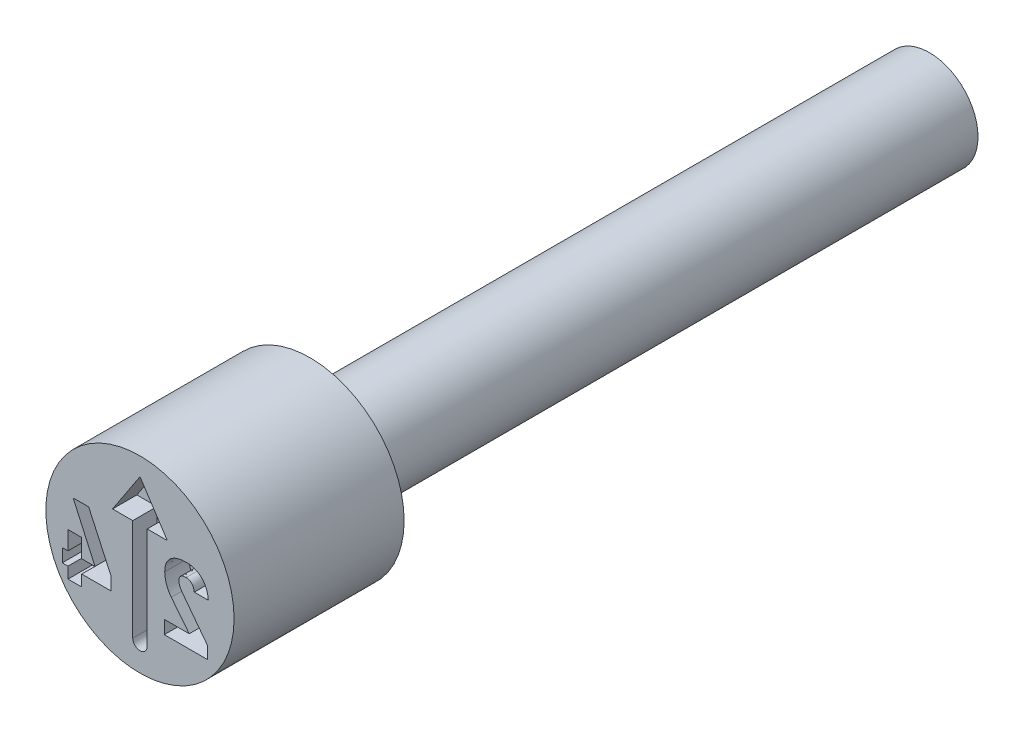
ISO-10303-21;
HEADER;
FILE_DESCRIPTION(('STEP AP214'),'2;1');
FILE_NAME('part.step','',(''),(''),'','','');
FILE_SCHEMA(('AUTOMOTIVE_DESIGN { 1 0 10303 214 1 1 1 1 }'));
ENDSEC;
DATA;
#1=APPLICATION_CONTEXT('core data for automotive mechanical design processes');
#2=APPLICATION_PROTOCOL_DEFINITION('international standard','automotive_design',2000,#1);
#3=PRODUCT_CONTEXT('',#1,'mechanical');
#4=PRODUCT('Part','Part','',(#3));
#5=PRODUCT_RELATED_PRODUCT_CATEGORY('part','',(#4));
#6=PRODUCT_DEFINITION_FORMATION('','',#4);
#7=PRODUCT_DEFINITION_CONTEXT('part definition',#1,'design');
#8=PRODUCT_DEFINITION('design','',#6,#7);
#9=PRODUCT_DEFINITION_SHAPE('','',#8);
#10=(LENGTH_UNIT() NAMED_UNIT(*) SI_UNIT(.MILLI.,.METRE.));
#11=(NAMED_UNIT(*) PLANE_ANGLE_UNIT() SI_UNIT($,.RADIAN.));
#12=(NAMED_UNIT(*) SI_UNIT($,.STERADIAN.) SOLID_ANGLE_UNIT());
#13=UNCERTAINTY_MEASURE_WITH_UNIT(LENGTH_MEASURE(1.E-05),#10,'distance_accuracy_value','');
#14=(GEOMETRIC_REPRESENTATION_CONTEXT(3) GLOBAL_UNCERTAINTY_ASSIGNED_CONTEXT((#13)) GLOBAL_UNIT_ASSIGNED_CONTEXT((#10,
#11,#12)) REPRESENTATION_CONTEXT('',''));
#15=CARTESIAN_POINT('',(0.,0.,0.));
#16=DIRECTION('',(0.,0.,1.));
#17=DIRECTION('',(1.,0.,0.));
#18=AXIS2_PLACEMENT_3D('',#15,#16,#17);
#19=CARTESIAN_POINT('',(0.,0.799999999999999,-2.8));
#20=DIRECTION('',(0.,0.,1.));
#21=DIRECTION('',(1.,0.,0.));
#22=AXIS2_PLACEMENT_3D('',#19,#20,#21);
#23=PLANE('',#22);
#24=CARTESIAN_POINT('',(0.,0.,-2.8));
#25=DIRECTION('',(0.,0.,1.));
#26=DIRECTION('',(1.,0.,0.));
#27=AXIS2_PLACEMENT_3D('',#24,#25,#26);
#28=CIRCLE('',#27,1.55);
#29=CARTESIAN_POINT('',(1.55,0.,-2.8));
#30=VERTEX_POINT('',#29);
#31=EDGE_CURVE('E11',#30,#30,#28,.T.);
#32=ORIENTED_EDGE('',*,*,#31,.F.);
#33=EDGE_LOOP('',(#32));
#34=FACE_BOUND('',#33,.T.);
#35=CARTESIAN_POINT('',(0.,0.,-2.8));
#36=DIRECTION('',(0.,0.,1.));
#37=DIRECTION('',(1.,0.,0.));
#38=AXIS2_PLACEMENT_3D('',#35,#36,#37);
#39=CIRCLE('',#38,0.799999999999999);
#40=CARTESIAN_POINT('',(0.799999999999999,0.,-2.8));
#41=VERTEX_POINT('',#40);
#42=EDGE_CURVE('E444',#41,#41,#39,.T.);
#43=ORIENTED_EDGE('',*,*,#42,.T.);
#44=EDGE_LOOP('',(#43));
#45=FACE_BOUND('',#44,.T.);
#46=ADVANCED_FACE('F35',(#34,#45),#23,.F.);
#47=CARTESIAN_POINT('',(0.,0.,-0.403888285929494));
#48=DIRECTION('',(0.,0.,1.));
#49=DIRECTION('',(1.,0.,0.));
#50=AXIS2_PLACEMENT_3D('',#47,#48,#49);
#51=CYLINDRICAL_SURFACE('',#50,1.55);
#52=CARTESIAN_POINT('',(0.,0.,0.));
#53=DIRECTION('',(0.,0.,1.));
#54=DIRECTION('',(1.,0.,0.));
#55=AXIS2_PLACEMENT_3D('',#52,#53,#54);
#56=CIRCLE('',#55,1.55);
#57=CARTESIAN_POINT('',(1.55,0.,0.));
#58=VERTEX_POINT('',#57);
#59=EDGE_CURVE('E42',#58,#58,#56,.T.);
#60=ORIENTED_EDGE('',*,*,#59,.F.);
#61=EDGE_LOOP('',(#60));
#62=FACE_BOUND('',#61,.T.);
#63=ORIENTED_EDGE('',*,*,#31,.T.);
#64=EDGE_LOOP('',(#63));
#65=FACE_BOUND('',#64,.T.);
#66=ADVANCED_FACE('F429',(#62,#65),#51,.T.);
#67=CARTESIAN_POINT('',(0.,1.55,0.));
#68=DIRECTION('',(0.,0.,-1.));
#69=DIRECTION('',(-1.,0.,0.));
#70=AXIS2_PLACEMENT_3D('',#67,#68,#69);
#71=PLANE('',#70);
#72=DIRECTION('',(-0.60539313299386,0.795926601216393,0.));
#73=VECTOR('',#72,1.);
#74=CARTESIAN_POINT('',(1.11073975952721,-0.596046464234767,0.));
#75=LINE('',#74,#73);
#76=CARTESIAN_POINT('',(1.11073975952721,-0.596046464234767,0.));
#77=VERTEX_POINT('',#76);
#78=CARTESIAN_POINT('',(0.698919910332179,-0.0546158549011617,0.));
#79=VERTEX_POINT('',#78);
#80=EDGE_CURVE('E709',#77,#79,#75,.T.);
#81=ORIENTED_EDGE('',*,*,#80,.F.);
#82=DIRECTION('',(0.,1.,0.));
#83=VECTOR('',#82,1.);
#84=CARTESIAN_POINT('',(1.11073975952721,-0.8,0.));
#85=LINE('',#84,#83);
#86=CARTESIAN_POINT('',(1.11073975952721,-0.8,0.));
#87=VERTEX_POINT('',#86);
#88=EDGE_CURVE('E49',#87,#77,#85,.T.);
#89=ORIENTED_EDGE('',*,*,#88,.F.);
#90=DIRECTION('',(1.,0.,0.));
#91=VECTOR('',#90,1.);
#92=CARTESIAN_POINT('',(0.401059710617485,-0.8,0.));
#93=LINE('',#92,#91);
#94=CARTESIAN_POINT('',(0.401059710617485,-0.8,0.));
#95=VERTEX_POINT('',#94);
#96=EDGE_CURVE('E308',#95,#87,#93,.T.);
#97=ORIENTED_EDGE('',*,*,#96,.F.);
#98=DIRECTION('',(0.,-1.,0.));
#99=VECTOR('',#98,1.);
#100=CARTESIAN_POINT('',(0.401059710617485,-0.582107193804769,0.));
#101=LINE('',#100,#99);
#102=CARTESIAN_POINT('',(0.401059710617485,-0.582107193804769,0.));
#103=VERTEX_POINT('',#102);
#104=EDGE_CURVE('E311',#103,#95,#101,.T.);
#105=ORIENTED_EDGE('',*,*,#104,.F.);
#106=DIRECTION('',(-1.,0.,0.));
#107=VECTOR('',#106,1.);
#108=CARTESIAN_POINT('',(0.811167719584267,-0.582107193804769,0.));
#109=LINE('',#108,#107);
#110=CARTESIAN_POINT('',(0.811167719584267,-0.582107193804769,0.));
#111=VERTEX_POINT('',#110);
#112=EDGE_CURVE('E643',#111,#103,#109,.T.);
#113=ORIENTED_EDGE('',*,*,#112,.F.);
#114=DIRECTION('',(0.620676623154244,-0.78406666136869,0.));
#115=VECTOR('',#114,1.);
#116=CARTESIAN_POINT('',(0.515753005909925,-0.208926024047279,0.));
#117=LINE('',#116,#115);
#118=CARTESIAN_POINT('',(0.515753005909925,-0.20892602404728,0.));
#119=VERTEX_POINT('',#118);
#120=EDGE_CURVE('E646',#119,#111,#117,.T.);
#121=ORIENTED_EDGE('',*,*,#120,.F.);
#122=CARTESIAN_POINT('',(0.407662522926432,0.0987161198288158,0.));
#123=CARTESIAN_POINT('',(0.407976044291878,0.0850857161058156,0.));
#124=CARTESIAN_POINT('',(0.408603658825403,0.0578000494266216,0.));
#125=CARTESIAN_POINT('',(0.414201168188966,0.0170361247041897,0.));
#126=CARTESIAN_POINT('',(0.423353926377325,-0.0234922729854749,0.));
#127=CARTESIAN_POINT('',(0.435772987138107,-0.063643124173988,0.));
#128=CARTESIAN_POINT('',(0.451280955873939,-0.10274599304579,0.));
#129=CARTESIAN_POINT('',(0.469788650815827,-0.140177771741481,0.));
#130=CARTESIAN_POINT('',(0.490918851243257,-0.175842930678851,0.));
#131=CARTESIAN_POINT('',(0.507476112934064,-0.197899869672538,0.));
#132=CARTESIAN_POINT('',(0.515753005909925,-0.20892602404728,0.));
#133=B_SPLINE_CURVE_WITH_KNOTS('',3,(#122,#123,#124,#125,#126,#127,#128,#129,#130,#131,#132),
.UNSPECIFIED.,.F.,.F.,(4,1,1,1,1,1,1,1,4),(0.,0.123148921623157,0.246522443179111,
0.371108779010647,0.498350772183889,0.625999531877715,0.750879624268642,0.875465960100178,1.),.UNSPECIFIED.);
#134=CARTESIAN_POINT('',(0.407662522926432,0.0987161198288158,0.));
#135=VERTEX_POINT('',#134);
#136=EDGE_CURVE('E649',#135,#119,#133,.T.);
#137=ORIENTED_EDGE('',*,*,#136,.F.);
#138=DIRECTION('',(0.,-1.,0.));
#139=VECTOR('',#138,1.);
#140=CARTESIAN_POINT('',(0.407662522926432,0.099694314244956,0.));
#141=LINE('',#140,#139);
#142=CARTESIAN_POINT('',(0.407662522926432,0.099694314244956,0.));
#143=VERTEX_POINT('',#142);
#144=EDGE_CURVE('E654',#143,#135,#141,.T.);
#145=ORIENTED_EDGE('',*,*,#144,.F.);
#146=CARTESIAN_POINT('',(0.762502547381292,0.412471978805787,0.));
#147=CARTESIAN_POINT('',(0.744465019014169,0.412094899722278,0.));
#148=CARTESIAN_POINT('',(0.709554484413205,0.411365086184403,0.));
#149=CARTESIAN_POINT('',(0.6592856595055,0.404494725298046,0.));
#150=CARTESIAN_POINT('',(0.613062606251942,0.393061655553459,0.));
#151=CARTESIAN_POINT('',(0.571001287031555,0.376998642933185,0.));
#152=CARTESIAN_POINT('',(0.533377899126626,0.356350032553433,0.));
#153=CARTESIAN_POINT('',(0.500018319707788,0.331840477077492,0.));
#154=CARTESIAN_POINT('',(0.471864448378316,0.302518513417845,0.));
#155=CARTESIAN_POINT('',(0.448445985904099,0.269208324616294,0.));
#156=CARTESIAN_POINT('',(0.429985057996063,0.232038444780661,0.));
#157=CARTESIAN_POINT('',(0.41705693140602,0.191040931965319,0.));
#158=CARTESIAN_POINT('',(0.409139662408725,0.146545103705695,0.));
#159=CARTESIAN_POINT('',(0.408164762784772,0.115623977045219,0.));
#160=CARTESIAN_POINT('',(0.407662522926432,0.099694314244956,0.));
#161=B_SPLINE_CURVE_WITH_KNOTS('',3,(#146,#147,#148,#149,#150,#151,#152,#153,#154,#155,#156,
#157,#158,#159,#160),.UNSPECIFIED.,.F.,.F.,(4,1,1,1,1,1,1,1,1,1,1,1,4),(0.,0.100715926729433,
0.194929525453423,0.2827284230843,0.366191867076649,0.44566981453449,0.521804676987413,
0.596515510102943,0.671682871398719,0.748455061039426,0.827368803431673,0.911065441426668,1.),.UNSPECIFIED.);
#162=CARTESIAN_POINT('',(0.762502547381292,0.412471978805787,0.));
#163=VERTEX_POINT('',#162);
#164=EDGE_CURVE('E660',#163,#143,#161,.T.);
#165=ORIENTED_EDGE('',*,*,#164,.F.);
#166=CARTESIAN_POINT('',(1.12565722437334,0.0534746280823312,0.));
#167=CARTESIAN_POINT('',(1.12399612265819,0.0715403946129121,0.));
#168=CARTESIAN_POINT('',(1.12076019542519,0.10673360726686,0.));
#169=CARTESIAN_POINT('',(1.10975712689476,0.15734426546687,0.));
#170=CARTESIAN_POINT('',(1.09350240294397,0.203913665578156,0.));
#171=CARTESIAN_POINT('',(1.07273473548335,0.246570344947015,0.));
#172=CARTESIAN_POINT('',(1.04726995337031,0.284775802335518,0.));
#173=CARTESIAN_POINT('',(1.01772322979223,0.318519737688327,0.));
#174=CARTESIAN_POINT('',(0.983767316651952,0.347146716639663,0.));
#175=CARTESIAN_POINT('',(0.945990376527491,0.370934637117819,0.));
#176=CARTESIAN_POINT('',(0.904557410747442,0.389551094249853,0.));
#177=CARTESIAN_POINT('',(0.859975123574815,0.403115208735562,0.));
#178=CARTESIAN_POINT('',(0.812176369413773,0.410934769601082,0.));
#179=CARTESIAN_POINT('',(0.779323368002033,0.41195144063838,0.));
#180=CARTESIAN_POINT('',(0.762502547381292,0.412471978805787,0.));
#181=B_SPLINE_CURVE_WITH_KNOTS('',3,(#166,#167,#168,#169,#170,#171,#172,#173,#174,#175,#176,
#177,#178,#179,#180),.UNSPECIFIED.,.F.,.F.,(4,1,1,1,1,1,1,1,1,1,1,1,4),(0.,0.0953291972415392,
0.185707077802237,0.271513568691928,0.354131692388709,0.434493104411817,0.512233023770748,
0.58917600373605,0.667186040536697,0.746219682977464,0.827302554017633,0.911578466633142,1.),.UNSPECIFIED.);
#182=CARTESIAN_POINT('',(1.12565722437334,0.0534746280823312,0.));
#183=VERTEX_POINT('',#182);
#184=EDGE_CURVE('E665',#183,#163,#181,.T.);
#185=ORIENTED_EDGE('',*,*,#184,.F.);
#186=DIRECTION('',(0.,1.,0.));
#187=VECTOR('',#186,1.);
#188=CARTESIAN_POINT('',(1.12565722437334,0.052496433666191,0.));
#189=LINE('',#188,#187);
#190=CARTESIAN_POINT('',(1.12565722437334,0.052496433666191,0.));
#191=VERTEX_POINT('',#190);
#192=EDGE_CURVE('E673',#191,#183,#189,.T.);
#193=ORIENTED_EDGE('',*,*,#192,.F.);
#194=DIRECTION('',(1.,0.,0.));
#195=VECTOR('',#194,1.);
#196=CARTESIAN_POINT('',(0.893825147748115,0.052496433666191,0.));
#197=LINE('',#196,#195);
#198=CARTESIAN_POINT('',(0.893825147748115,0.052496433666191,0.));
#199=VERTEX_POINT('',#198);
#200=EDGE_CURVE('E679',#199,#191,#197,.T.);
#201=ORIENTED_EDGE('',*,*,#200,.F.);
#202=DIRECTION('',(0.,-1.,0.));
#203=VECTOR('',#202,1.);
#204=CARTESIAN_POINT('',(0.893825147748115,0.0534746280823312,0.));
#205=LINE('',#204,#203);
#206=CARTESIAN_POINT('',(0.893825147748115,0.0534746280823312,0.));
#207=VERTEX_POINT('',#206);
#208=EDGE_CURVE('E682',#207,#199,#205,.T.);
#209=ORIENTED_EDGE('',*,*,#208,.F.);
#210=CARTESIAN_POINT('',(0.760790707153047,0.194579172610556,0.));
#211=CARTESIAN_POINT('',(0.769721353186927,0.194201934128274,0.));
#212=CARTESIAN_POINT('',(0.787052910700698,0.193469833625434,0.));
#213=CARTESIAN_POINT('',(0.811707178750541,0.186493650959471,0.));
#214=CARTESIAN_POINT('',(0.83360840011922,0.174650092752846,0.));
#215=CARTESIAN_POINT('',(0.852567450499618,0.158282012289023,0.));
#216=CARTESIAN_POINT('',(0.868475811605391,0.137690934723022,0.));
#217=CARTESIAN_POINT('',(0.880201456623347,0.112885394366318,0.));
#218=CARTESIAN_POINT('',(0.889644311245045,0.0846928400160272,0.));
#219=CARTESIAN_POINT('',(0.892384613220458,0.0642310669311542,0.));
#220=CARTESIAN_POINT('',(0.893825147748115,0.0534746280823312,0.));
#221=B_SPLINE_CURVE_WITH_KNOTS('',3,(#210,#211,#212,#213,#214,#215,#216,#217,#218,#219,#220),
.UNSPECIFIED.,.F.,.F.,(4,1,1,1,1,1,1,1,4),(0.,0.124212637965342,0.241057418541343,
0.353359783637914,0.468536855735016,0.587568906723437,0.713021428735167,0.849139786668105,1.),.UNSPECIFIED.);
#222=CARTESIAN_POINT('',(0.760790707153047,0.194579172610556,0.));
#223=VERTEX_POINT('',#222);
#224=EDGE_CURVE('E685',#223,#207,#221,.T.);
#225=ORIENTED_EDGE('',*,*,#224,.F.);
#226=CARTESIAN_POINT('',(0.640472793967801,0.0930915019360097,0.));
#227=CARTESIAN_POINT('',(0.64080098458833,0.100797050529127,0.));
#228=CARTESIAN_POINT('',(0.641426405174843,0.115481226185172,0.));
#229=CARTESIAN_POINT('',(0.647464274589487,0.136140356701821,0.));
#230=CARTESIAN_POINT('',(0.657448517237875,0.154004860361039,0.));
#231=CARTESIAN_POINT('',(0.671433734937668,0.168980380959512,0.));
#232=CARTESIAN_POINT('',(0.689223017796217,0.180489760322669,0.));
#233=CARTESIAN_POINT('',(0.710206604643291,0.188897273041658,0.));
#234=CARTESIAN_POINT('',(0.734496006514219,0.193654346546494,0.));
#235=CARTESIAN_POINT('',(0.751721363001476,0.194260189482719,0.));
#236=CARTESIAN_POINT('',(0.760790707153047,0.194579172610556,0.));
#237=B_SPLINE_CURVE_WITH_KNOTS('',3,(#226,#227,#228,#229,#230,#231,#232,#233,#234,#235,#236),
.UNSPECIFIED.,.F.,.F.,(4,1,1,1,1,1,1,1,4),(0.,0.129170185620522,0.246154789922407,
0.357734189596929,0.470108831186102,0.586692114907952,0.710769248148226,0.847716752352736,1.),.UNSPECIFIED.);
#238=CARTESIAN_POINT('',(0.640472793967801,0.0930915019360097,0.));
#239=VERTEX_POINT('',#238);
#240=EDGE_CURVE('E690',#239,#223,#237,.T.);
#241=ORIENTED_EDGE('',*,*,#240,.F.);
#242=DIRECTION('',(0.,1.,0.));
#243=VECTOR('',#242,1.);
#244=CARTESIAN_POINT('',(0.640472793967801,0.0913796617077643,0.));
#245=LINE('',#244,#243);
#246=CARTESIAN_POINT('',(0.640472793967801,0.0913796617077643,0.));
#247=VERTEX_POINT('',#246);
#248=EDGE_CURVE('E698',#247,#239,#245,.T.);
#249=ORIENTED_EDGE('',*,*,#248,.F.);
#250=CARTESIAN_POINT('',(0.698919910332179,-0.0546158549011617,0.));
#251=CARTESIAN_POINT('',(0.690282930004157,-0.0426328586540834,0.));
#252=CARTESIAN_POINT('',(0.673421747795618,-0.0192395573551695,0.));
#253=CARTESIAN_POINT('',(0.658336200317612,0.0130263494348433,0.));
#254=CARTESIAN_POINT('',(0.648752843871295,0.0383261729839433,0.));
#255=CARTESIAN_POINT('',(0.644322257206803,0.0566782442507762,0.));
#256=CARTESIAN_POINT('',(0.641042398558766,0.0742269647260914,0.));
#257=CARTESIAN_POINT('',(0.64066005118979,0.0857407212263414,0.));
#258=CARTESIAN_POINT('',(0.640472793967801,0.0913796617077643,0.));
#259=B_SPLINE_CURVE_WITH_KNOTS('',3,(#250,#251,#252,#253,#254,#255,#256,#257,#258),
.UNSPECIFIED.,.F.,.F.,(4,1,1,1,1,1,4),(0.,0.276737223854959,0.540248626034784,0.66563356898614,
0.784034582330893,0.894229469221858,1.),.UNSPECIFIED.);
#260=EDGE_CURVE('E704',#79,#247,#259,.T.);
#261=ORIENTED_EDGE('',*,*,#260,.F.);
#262=EDGE_LOOP('',(#81,#89,#97,#105,#113,#121,#137,#145,#165,#185,#193,#201,#209,#225,#241,#249,#261));
#263=FACE_BOUND('',#262,.T.);
#264=DIRECTION('',(0.,-1.,0.));
#265=VECTOR('',#264,1.);
#266=CARTESIAN_POINT('',(-1.18512166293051,-0.0942327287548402,0.));
#267=LINE('',#266,#265);
#268=CARTESIAN_POINT('',(-1.18512166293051,-0.0942327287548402,0.));
#269=VERTEX_POINT('',#268);
#270=CARTESIAN_POINT('',(-1.18512166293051,-0.397962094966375,0.));
#271=VERTEX_POINT('',#270);
#272=EDGE_CURVE('E592',#269,#271,#267,.T.);
#273=ORIENTED_EDGE('',*,*,#272,.F.);
#274=DIRECTION('',(-1.,0.,0.));
#275=VECTOR('',#274,1.);
#276=CARTESIAN_POINT('',(-0.958914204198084,-0.0942327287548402,0.));
#277=LINE('',#276,#275);
#278=CARTESIAN_POINT('',(-0.958914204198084,-0.0942327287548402,0.));
#279=VERTEX_POINT('',#278);
#280=EDGE_CURVE('E595',#279,#269,#277,.T.);
#281=ORIENTED_EDGE('',*,*,#280,.F.);
#282=DIRECTION('',(0.,1.,0.));
#283=VECTOR('',#282,1.);
#284=CARTESIAN_POINT('',(-0.958914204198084,-0.800733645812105,0.));
#285=LINE('',#284,#283);
#286=CARTESIAN_POINT('',(-0.958914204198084,-0.397962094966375,0.));
#287=VERTEX_POINT('',#286);
#288=EDGE_CURVE('E600',#287,#279,#285,.T.);
#289=ORIENTED_EDGE('',*,*,#288,.F.);
#290=DIRECTION('',(-1.,0.,0.));
#291=VECTOR('',#290,1.);
#292=CARTESIAN_POINT('',(-0.740287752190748,-0.397962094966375,0.));
#293=LINE('',#292,#291);
#294=CARTESIAN_POINT('',(-0.740287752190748,-0.397962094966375,0.));
#295=VERTEX_POINT('',#294);
#296=EDGE_CURVE('E533',#295,#287,#293,.T.);
#297=ORIENTED_EDGE('',*,*,#296,.F.);
#298=DIRECTION('',(0.411526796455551,-0.911397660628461,0.));
#299=VECTOR('',#298,1.);
#300=CARTESIAN_POINT('',(-1.10026329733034,0.399266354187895,0.));
#301=LINE('',#300,#299);
#302=CARTESIAN_POINT('',(-1.10026329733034,0.399266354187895,0.));
#303=VERTEX_POINT('',#302);
#304=EDGE_CURVE('E537',#303,#295,#301,.T.);
#305=ORIENTED_EDGE('',*,*,#304,.F.);
#306=DIRECTION('',(-1.,0.,0.));
#307=VECTOR('',#306,1.);
#308=CARTESIAN_POINT('',(-0.844220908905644,0.399266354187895,0.));
#309=LINE('',#308,#307);
#310=CARTESIAN_POINT('',(-0.844220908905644,0.399266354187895,0.));
#311=VERTEX_POINT('',#310);
#312=EDGE_CURVE('E540',#311,#303,#309,.T.);
#313=ORIENTED_EDGE('',*,*,#312,.F.);
#314=DIRECTION('',(-0.416436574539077,0.909164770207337,0.));
#315=VECTOR('',#314,1.);
#316=CARTESIAN_POINT('',(-0.474463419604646,-0.407988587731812,0.));
#317=LINE('',#316,#315);
#318=CARTESIAN_POINT('',(-0.474463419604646,-0.407988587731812,0.));
#319=VERTEX_POINT('',#318);
#320=EDGE_CURVE('E543',#319,#311,#317,.T.);
#321=ORIENTED_EDGE('',*,*,#320,.F.);
#322=DIRECTION('',(0.,1.,0.));
#323=VECTOR('',#322,1.);
#324=CARTESIAN_POINT('',(-0.474463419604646,-0.615854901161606,0.));
#325=LINE('',#324,#323);
#326=CARTESIAN_POINT('',(-0.474463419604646,-0.615854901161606,0.));
#327=VERTEX_POINT('',#326);
#328=EDGE_CURVE('E546',#327,#319,#325,.T.);
#329=ORIENTED_EDGE('',*,*,#328,.F.);
#330=DIRECTION('',(1.,0.,0.));
#331=VECTOR('',#330,1.);
#332=CARTESIAN_POINT('',(-1.279272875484,-0.615854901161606,0.));
#333=LINE('',#332,#331);
#334=CARTESIAN_POINT('',(-0.958914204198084,-0.615854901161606,0.));
#335=VERTEX_POINT('',#334);
#336=EDGE_CURVE('E529',#335,#327,#333,.T.);
#337=ORIENTED_EDGE('',*,*,#336,.F.);
#338=CARTESIAN_POINT('',(-0.958914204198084,-0.800733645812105,0.));
#339=VERTEX_POINT('',#338);
#340=EDGE_CURVE('E598',#339,#335,#285,.T.);
#341=ORIENTED_EDGE('',*,*,#340,.F.);
#342=DIRECTION('',(1.,0.,0.));
#343=VECTOR('',#342,1.);
#344=CARTESIAN_POINT('',(-1.18512166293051,-0.800733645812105,0.));
#345=LINE('',#344,#343);
#346=CARTESIAN_POINT('',(-1.18512166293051,-0.800733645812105,0.));
#347=VERTEX_POINT('',#346);
#348=EDGE_CURVE('E589',#347,#339,#345,.T.);
#349=ORIENTED_EDGE('',*,*,#348,.F.);
#350=CARTESIAN_POINT('',(-1.18512166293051,-0.615854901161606,0.));
#351=VERTEX_POINT('',#350);
#352=EDGE_CURVE('E594',#351,#347,#267,.T.);
#353=ORIENTED_EDGE('',*,*,#352,.F.);
#354=CARTESIAN_POINT('',(-1.279272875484,-0.615854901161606,0.));
#355=VERTEX_POINT('',#354);
#356=EDGE_CURVE('E525',#355,#351,#333,.T.);
#357=ORIENTED_EDGE('',*,*,#356,.F.);
#358=DIRECTION('',(0.,-1.,0.));
#359=VECTOR('',#358,1.);
#360=CARTESIAN_POINT('',(-1.279272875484,-0.397962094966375,0.));
#361=LINE('',#360,#359);
#362=CARTESIAN_POINT('',(-1.279272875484,-0.397962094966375,0.));
#363=VERTEX_POINT('',#362);
#364=EDGE_CURVE('E530',#363,#355,#361,.T.);
#365=ORIENTED_EDGE('',*,*,#364,.F.);
#366=EDGE_CURVE('E536',#271,#363,#293,.T.);
#367=ORIENTED_EDGE('',*,*,#366,.F.);
#368=EDGE_LOOP('',(#273,#281,#289,#297,#305,#313,#321,#329,#337,#341,#349,#353,#357,#365,#367));
#369=FACE_BOUND('',#368,.T.);
#370=DIRECTION('',(0.,1.,0.));
#371=VECTOR('',#370,1.);
#372=CARTESIAN_POINT('',(0.119045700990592,0.566469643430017,0.));
#373=LINE('',#372,#371);
#374=CARTESIAN_POINT('',(0.119045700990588,-1.11010114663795,0.));
#375=VERTEX_POINT('',#374);
#376=CARTESIAN_POINT('',(0.119045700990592,0.566469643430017,0.));
#377=VERTEX_POINT('',#376);
#378=EDGE_CURVE('E483',#375,#377,#373,.T.);
#379=ORIENTED_EDGE('',*,*,#378,.F.);
#380=CARTESIAN_POINT('',(1.02140308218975E-13,-1.11010114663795,0.));
#381=DIRECTION('',(0.,0.,1.));
#382=DIRECTION('',(1.,0.,0.));
#383=AXIS2_PLACEMENT_3D('',#380,#381,#382);
#384=CIRCLE('',#383,0.119045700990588);
#385=CARTESIAN_POINT('',(-0.119045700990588,-1.11010114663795,0.));
#386=VERTEX_POINT('',#385);
#387=EDGE_CURVE('E486',#386,#375,#384,.T.);
#388=ORIENTED_EDGE('',*,*,#387,.F.);
#389=DIRECTION('',(0.,-1.,0.));
#390=VECTOR('',#389,1.);
#391=CARTESIAN_POINT('',(-0.119045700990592,0.566469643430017,0.));
#392=LINE('',#391,#390);
#393=CARTESIAN_POINT('',(-0.119045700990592,0.566469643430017,0.));
#394=VERTEX_POINT('',#393);
#395=EDGE_CURVE('E467',#394,#386,#392,.T.);
#396=ORIENTED_EDGE('',*,*,#395,.F.);
#397=DIRECTION('',(1.,0.,0.));
#398=VECTOR('',#397,1.);
#399=CARTESIAN_POINT('',(-0.451198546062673,0.566469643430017,0.));
#400=LINE('',#399,#398);
#401=CARTESIAN_POINT('',(-0.451198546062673,0.566469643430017,0.));
#402=VERTEX_POINT('',#401);
#403=EDGE_CURVE('E471',#402,#394,#400,.T.);
#404=ORIENTED_EDGE('',*,*,#403,.F.);
#405=DIRECTION('',(-0.550159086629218,-0.835059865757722,0.));
#406=VECTOR('',#405,1.);
#407=CARTESIAN_POINT('',(0.,1.25132209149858,0.));
#408=LINE('',#407,#406);
#409=CARTESIAN_POINT('',(0.,1.25132209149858,0.));
#410=VERTEX_POINT('',#409);
#411=EDGE_CURVE('E474',#410,#402,#408,.T.);
#412=ORIENTED_EDGE('',*,*,#411,.F.);
#413=DIRECTION('',(-0.550159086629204,0.835059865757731,0.));
#414=VECTOR('',#413,1.);
#415=CARTESIAN_POINT('',(0.,1.25132209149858,0.));
#416=LINE('',#415,#414);
#417=CARTESIAN_POINT('',(0.451198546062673,0.566469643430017,0.));
#418=VERTEX_POINT('',#417);
#419=EDGE_CURVE('E477',#418,#410,#416,.T.);
#420=ORIENTED_EDGE('',*,*,#419,.F.);
#421=DIRECTION('',(1.,0.,0.));
#422=VECTOR('',#421,1.);
#423=CARTESIAN_POINT('',(0.451198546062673,0.566469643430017,0.));
#424=LINE('',#423,#422);
#425=EDGE_CURVE('E480',#377,#418,#424,.T.);
#426=ORIENTED_EDGE('',*,*,#425,.F.);
#427=EDGE_LOOP('',(#379,#388,#396,#404,#412,#420,#426));
#428=FACE_BOUND('',#427,.T.);
#429=ORIENTED_EDGE('',*,*,#59,.T.);
#430=EDGE_LOOP('',(#429));
#431=FACE_BOUND('',#430,.T.);
#432=ADVANCED_FACE('F426',(#263,#369,#428,#431),#71,.F.);
#433=CARTESIAN_POINT('',(0.,0.,-13.));
#434=DIRECTION('',(0.,0.,1.));
#435=DIRECTION('',(1.,0.,0.));
#436=AXIS2_PLACEMENT_3D('',#433,#434,#435);
#437=PLANE('',#436);
#438=CARTESIAN_POINT('',(0.,0.,-13.));
#439=DIRECTION('',(0.,0.,1.));
#440=DIRECTION('',(1.,0.,0.));
#441=AXIS2_PLACEMENT_3D('',#438,#439,#440);
#442=CIRCLE('',#441,0.8);
#443=CARTESIAN_POINT('',(0.8,0.,-13.));
#444=VERTEX_POINT('',#443);
#445=EDGE_CURVE('E445',#444,#444,#442,.T.);
#446=ORIENTED_EDGE('',*,*,#445,.F.);
#447=EDGE_LOOP('',(#446));
#448=FACE_BOUND('',#447,.T.);
#449=ADVANCED_FACE('F422',(#448),#437,.F.);
#450=CARTESIAN_POINT('',(0.,0.,-0.403888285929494));
#451=DIRECTION('',(0.,0.,1.));
#452=DIRECTION('',(1.,0.,0.));
#453=AXIS2_PLACEMENT_3D('',#450,#451,#452);
#454=CYLINDRICAL_SURFACE('',#453,0.8);
#455=ORIENTED_EDGE('',*,*,#42,.F.);
#456=EDGE_LOOP('',(#455));
#457=FACE_BOUND('',#456,.T.);
#458=ORIENTED_EDGE('',*,*,#445,.T.);
#459=EDGE_LOOP('',(#458));
#460=FACE_BOUND('',#459,.T.);
#461=ADVANCED_FACE('F418',(#457,#460),#454,.T.);
#462=CARTESIAN_POINT('',(1.02140308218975E-13,-1.11010114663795,-0.4));
#463=DIRECTION('',(0.,0.,1.));
#464=DIRECTION('',(1.,0.,0.));
#465=AXIS2_PLACEMENT_3D('',#462,#463,#464);
#466=CYLINDRICAL_SURFACE('',#465,0.119045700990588);
#467=ORIENTED_EDGE('',*,*,#387,.T.);
#468=DIRECTION('',(0.,0.,1.));
#469=VECTOR('',#468,1.);
#470=CARTESIAN_POINT('',(0.119045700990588,-1.11010114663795,-0.4));
#471=LINE('',#470,#469);
#472=CARTESIAN_POINT('',(0.119045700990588,-1.11010114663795,-0.4));
#473=VERTEX_POINT('',#472);
#474=EDGE_CURVE('E453',#473,#375,#471,.T.);
#475=ORIENTED_EDGE('',*,*,#474,.F.);
#476=CARTESIAN_POINT('',(1.02140308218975E-13,-1.11010114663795,-0.4));
#477=DIRECTION('',(0.,0.,1.));
#478=DIRECTION('',(1.,0.,0.));
#479=AXIS2_PLACEMENT_3D('',#476,#477,#478);
#480=CIRCLE('',#479,0.119045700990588);
#481=CARTESIAN_POINT('',(-0.119045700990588,-1.11010114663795,-0.4));
#482=VERTEX_POINT('',#481);
#483=EDGE_CURVE('E470',#482,#473,#480,.T.);
#484=ORIENTED_EDGE('',*,*,#483,.F.);
#485=DIRECTION('',(0.,0.,1.));
#486=VECTOR('',#485,1.);
#487=CARTESIAN_POINT('',(-0.119045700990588,-1.11010114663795,-0.4));
#488=LINE('',#487,#486);
#489=EDGE_CURVE('E446',#482,#386,#488,.T.);
#490=ORIENTED_EDGE('',*,*,#489,.T.);
#491=EDGE_LOOP('',(#467,#475,#484,#490));
#492=FACE_BOUND('',#491,.T.);
#493=ADVANCED_FACE('F396',(#492),#466,.F.);
#494=CARTESIAN_POINT('',(-0.119045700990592,0.566469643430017,-0.4));
#495=DIRECTION('',(-1.,0.,0.));
#496=DIRECTION('',(0.,-1.,0.));
#497=AXIS2_PLACEMENT_3D('',#494,#495,#496);
#498=PLANE('',#497);
#499=ORIENTED_EDGE('',*,*,#395,.T.);
#500=ORIENTED_EDGE('',*,*,#489,.F.);
#501=DIRECTION('',(0.,-1.,0.));
#502=VECTOR('',#501,1.);
#503=CARTESIAN_POINT('',(-0.119045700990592,0.566469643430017,-0.4));
#504=LINE('',#503,#502);
#505=CARTESIAN_POINT('',(-0.119045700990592,0.566469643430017,-0.4));
#506=VERTEX_POINT('',#505);
#507=EDGE_CURVE('E458',#506,#482,#504,.T.);
#508=ORIENTED_EDGE('',*,*,#507,.F.);
#509=DIRECTION('',(0.,0.,1.));
#510=VECTOR('',#509,1.);
#511=CARTESIAN_POINT('',(-0.119045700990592,0.566469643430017,-0.4));
#512=LINE('',#511,#510);
#513=EDGE_CURVE('E450',#506,#394,#512,.T.);
#514=ORIENTED_EDGE('',*,*,#513,.T.);
#515=EDGE_LOOP('',(#499,#500,#508,#514));
#516=FACE_BOUND('',#515,.T.);
#517=ADVANCED_FACE('F392',(#516),#498,.F.);
#518=CARTESIAN_POINT('',(-0.451198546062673,0.566469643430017,-0.4));
#519=DIRECTION('',(0.,-1.,0.));
#520=DIRECTION('',(0.,0.,-1.));
#521=AXIS2_PLACEMENT_3D('',#518,#519,#520);
#522=PLANE('',#521);
#523=ORIENTED_EDGE('',*,*,#403,.T.);
#524=ORIENTED_EDGE('',*,*,#513,.F.);
#525=DIRECTION('',(1.,0.,0.));
#526=VECTOR('',#525,1.);
#527=CARTESIAN_POINT('',(-0.451198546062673,0.566469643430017,-0.4));
#528=LINE('',#527,#526);
#529=CARTESIAN_POINT('',(-0.451198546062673,0.566469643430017,-0.4));
#530=VERTEX_POINT('',#529);
#531=EDGE_CURVE('E491',#530,#506,#528,.T.);
#532=ORIENTED_EDGE('',*,*,#531,.F.);
#533=DIRECTION('',(0.,0.,1.));
#534=VECTOR('',#533,1.);
#535=CARTESIAN_POINT('',(-0.451198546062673,0.566469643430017,-0.4));
#536=LINE('',#535,#534);
#537=EDGE_CURVE('E464',#530,#402,#536,.T.);
#538=ORIENTED_EDGE('',*,*,#537,.T.);
#539=EDGE_LOOP('',(#523,#524,#532,#538));
#540=FACE_BOUND('',#539,.T.);
#541=ADVANCED_FACE('F395',(#540),#522,.F.);
#542=CARTESIAN_POINT('',(0.,1.25132209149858,-0.4));
#543=DIRECTION('',(-0.835059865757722,0.550159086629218,0.));
#544=DIRECTION('',(-0.550159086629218,-0.835059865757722,0.));
#545=AXIS2_PLACEMENT_3D('',#542,#543,#544);
#546=PLANE('',#545);
#547=ORIENTED_EDGE('',*,*,#411,.T.);
#548=ORIENTED_EDGE('',*,*,#537,.F.);
#549=DIRECTION('',(-0.550159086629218,-0.835059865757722,0.));
#550=VECTOR('',#549,1.);
#551=CARTESIAN_POINT('',(0.,1.25132209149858,-0.4));
#552=LINE('',#551,#550);
#553=CARTESIAN_POINT('',(0.,1.25132209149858,-0.4));
#554=VERTEX_POINT('',#553);
#555=EDGE_CURVE('E494',#554,#530,#552,.T.);
#556=ORIENTED_EDGE('',*,*,#555,.F.);
#557=DIRECTION('',(0.,0.,1.));
#558=VECTOR('',#557,1.);
#559=CARTESIAN_POINT('',(0.,1.25132209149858,-0.4));
#560=LINE('',#559,#558);
#561=EDGE_CURVE('E462',#554,#410,#560,.T.);
#562=ORIENTED_EDGE('',*,*,#561,.T.);
#563=EDGE_LOOP('',(#547,#548,#556,#562));
#564=FACE_BOUND('',#563,.T.);
#565=ADVANCED_FACE('F400',(#564),#546,.F.);
#566=CARTESIAN_POINT('',(0.,1.25132209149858,-0.4));
#567=DIRECTION('',(0.835059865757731,0.550159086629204,0.));
#568=DIRECTION('',(-0.550159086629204,0.835059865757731,0.));
#569=AXIS2_PLACEMENT_3D('',#566,#567,#568);
#570=PLANE('',#569);
#571=ORIENTED_EDGE('',*,*,#419,.T.);
#572=ORIENTED_EDGE('',*,*,#561,.F.);
#573=DIRECTION('',(-0.550159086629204,0.835059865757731,0.));
#574=VECTOR('',#573,1.);
#575=CARTESIAN_POINT('',(0.,1.25132209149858,-0.4));
#576=LINE('',#575,#574);
#577=CARTESIAN_POINT('',(0.451198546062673,0.566469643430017,-0.4));
#578=VERTEX_POINT('',#577);
#579=EDGE_CURVE('E497',#578,#554,#576,.T.);
#580=ORIENTED_EDGE('',*,*,#579,.F.);
#581=DIRECTION('',(0.,0.,1.));
#582=VECTOR('',#581,1.);
#583=CARTESIAN_POINT('',(0.451198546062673,0.566469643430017,-0.4));
#584=LINE('',#583,#582);
#585=EDGE_CURVE('E460',#578,#418,#584,.T.);
#586=ORIENTED_EDGE('',*,*,#585,.T.);
#587=EDGE_LOOP('',(#571,#572,#580,#586));
#588=FACE_BOUND('',#587,.T.);
#589=ADVANCED_FACE('F404',(#588),#570,.F.);
#590=CARTESIAN_POINT('',(0.451198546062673,0.566469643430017,-0.4));
#591=DIRECTION('',(0.,-1.,0.));
#592=DIRECTION('',(0.,0.,-1.));
#593=AXIS2_PLACEMENT_3D('',#590,#591,#592);
#594=PLANE('',#593);
#595=ORIENTED_EDGE('',*,*,#425,.T.);
#596=ORIENTED_EDGE('',*,*,#585,.F.);
#597=DIRECTION('',(1.,0.,0.));
#598=VECTOR('',#597,1.);
#599=CARTESIAN_POINT('',(0.451198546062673,0.566469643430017,-0.4));
#600=LINE('',#599,#598);
#601=CARTESIAN_POINT('',(0.119045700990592,0.566469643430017,-0.4));
#602=VERTEX_POINT('',#601);
#603=EDGE_CURVE('E500',#602,#578,#600,.T.);
#604=ORIENTED_EDGE('',*,*,#603,.F.);
#605=DIRECTION('',(0.,0.,1.));
#606=VECTOR('',#605,1.);
#607=CARTESIAN_POINT('',(0.119045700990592,0.566469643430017,-0.4));
#608=LINE('',#607,#606);
#609=EDGE_CURVE('E457',#602,#377,#608,.T.);
#610=ORIENTED_EDGE('',*,*,#609,.T.);
#611=EDGE_LOOP('',(#595,#596,#604,#610));
#612=FACE_BOUND('',#611,.T.);
#613=ADVANCED_FACE('F408',(#612),#594,.F.);
#614=CARTESIAN_POINT('',(0.119045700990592,0.566469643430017,-0.4));
#615=DIRECTION('',(1.,0.,0.));
#616=DIRECTION('',(0.,1.,0.));
#617=AXIS2_PLACEMENT_3D('',#614,#615,#616);
#618=PLANE('',#617);
#619=ORIENTED_EDGE('',*,*,#378,.T.);
#620=ORIENTED_EDGE('',*,*,#609,.F.);
#621=DIRECTION('',(0.,1.,0.));
#622=VECTOR('',#621,1.);
#623=CARTESIAN_POINT('',(0.119045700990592,0.566469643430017,-0.4));
#624=LINE('',#623,#622);
#625=EDGE_CURVE('E503',#473,#602,#624,.T.);
#626=ORIENTED_EDGE('',*,*,#625,.F.);
#627=ORIENTED_EDGE('',*,*,#474,.T.);
#628=EDGE_LOOP('',(#619,#620,#626,#627));
#629=FACE_BOUND('',#628,.T.);
#630=ADVANCED_FACE('F390',(#629),#618,.F.);
#631=CARTESIAN_POINT('',(1.02140308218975E-13,-1.11010114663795,-0.4));
#632=DIRECTION('',(0.,0.,1.));
#633=DIRECTION('',(1.,0.,0.));
#634=AXIS2_PLACEMENT_3D('',#631,#632,#633);
#635=PLANE('',#634);
#636=ORIENTED_EDGE('',*,*,#483,.T.);
#637=ORIENTED_EDGE('',*,*,#625,.T.);
#638=ORIENTED_EDGE('',*,*,#603,.T.);
#639=ORIENTED_EDGE('',*,*,#579,.T.);
#640=ORIENTED_EDGE('',*,*,#555,.T.);
#641=ORIENTED_EDGE('',*,*,#531,.T.);
#642=ORIENTED_EDGE('',*,*,#507,.T.);
#643=EDGE_LOOP('',(#636,#637,#638,#639,#640,#641,#642));
#644=FACE_BOUND('',#643,.T.);
#645=ADVANCED_FACE('F387',(#644),#635,.T.);
#646=CARTESIAN_POINT('',(-1.279272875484,-0.615854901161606,-0.4));
#647=DIRECTION('',(0.,-1.,0.));
#648=DIRECTION('',(0.,0.,-1.));
#649=AXIS2_PLACEMENT_3D('',#646,#647,#648);
#650=PLANE('',#649);
#651=DIRECTION('',(0.,0.,1.));
#652=VECTOR('',#651,1.);
#653=CARTESIAN_POINT('',(-0.958914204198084,-0.615854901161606,-0.4));
#654=LINE('',#653,#652);
#655=CARTESIAN_POINT('',(-0.958914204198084,-0.615854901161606,-0.4));
#656=VERTEX_POINT('',#655);
#657=EDGE_CURVE('E549',#656,#335,#654,.T.);
#658=ORIENTED_EDGE('',*,*,#657,.T.);
#659=ORIENTED_EDGE('',*,*,#336,.T.);
#660=DIRECTION('',(0.,0.,1.));
#661=VECTOR('',#660,1.);
#662=CARTESIAN_POINT('',(-0.474463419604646,-0.615854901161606,-0.4));
#663=LINE('',#662,#661);
#664=CARTESIAN_POINT('',(-0.474463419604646,-0.615854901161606,-0.4));
#665=VERTEX_POINT('',#664);
#666=EDGE_CURVE('E522',#665,#327,#663,.T.);
#667=ORIENTED_EDGE('',*,*,#666,.F.);
#668=DIRECTION('',(1.,0.,0.));
#669=VECTOR('',#668,1.);
#670=CARTESIAN_POINT('',(-1.279272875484,-0.615854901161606,-0.4));
#671=LINE('',#670,#669);
#672=EDGE_CURVE('E552',#656,#665,#671,.T.);
#673=ORIENTED_EDGE('',*,*,#672,.F.);
#674=EDGE_LOOP('',(#658,#659,#667,#673));
#675=FACE_BOUND('',#674,.T.);
#676=ADVANCED_FACE('F364',(#675),#650,.F.);
#677=CARTESIAN_POINT('',(-0.740287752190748,-0.397962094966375,-0.4));
#678=DIRECTION('',(0.,1.,0.));
#679=DIRECTION('',(0.,0.,1.));
#680=AXIS2_PLACEMENT_3D('',#677,#678,#679);
#681=PLANE('',#680);
#682=DIRECTION('',(0.,0.,-1.));
#683=VECTOR('',#682,1.);
#684=CARTESIAN_POINT('',(-0.958914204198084,-0.397962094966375,-0.4));
#685=LINE('',#684,#683);
#686=CARTESIAN_POINT('',(-0.958914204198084,-0.397962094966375,-0.4));
#687=VERTEX_POINT('',#686);
#688=EDGE_CURVE('E573',#287,#687,#685,.T.);
#689=ORIENTED_EDGE('',*,*,#688,.T.);
#690=DIRECTION('',(-1.,0.,0.));
#691=VECTOR('',#690,1.);
#692=CARTESIAN_POINT('',(-0.740287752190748,-0.397962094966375,-0.4));
#693=LINE('',#692,#691);
#694=CARTESIAN_POINT('',(-0.740287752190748,-0.397962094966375,-0.4));
#695=VERTEX_POINT('',#694);
#696=EDGE_CURVE('E556',#695,#687,#693,.T.);
#697=ORIENTED_EDGE('',*,*,#696,.F.);
#698=DIRECTION('',(0.,0.,1.));
#699=VECTOR('',#698,1.);
#700=CARTESIAN_POINT('',(-0.740287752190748,-0.397962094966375,-0.4));
#701=LINE('',#700,#699);
#702=EDGE_CURVE('E515',#695,#295,#701,.T.);
#703=ORIENTED_EDGE('',*,*,#702,.T.);
#704=ORIENTED_EDGE('',*,*,#296,.T.);
#705=EDGE_LOOP('',(#689,#697,#703,#704));
#706=FACE_BOUND('',#705,.T.);
#707=ADVANCED_FACE('F373',(#706),#681,.F.);
#708=CARTESIAN_POINT('',(-0.474463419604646,-0.615854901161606,-0.4));
#709=DIRECTION('',(1.,0.,0.));
#710=DIRECTION('',(0.,0.,-1.));
#711=AXIS2_PLACEMENT_3D('',#708,#709,#710);
#712=PLANE('',#711);
#713=ORIENTED_EDGE('',*,*,#328,.T.);
#714=DIRECTION('',(0.,0.,1.));
#715=VECTOR('',#714,1.);
#716=CARTESIAN_POINT('',(-0.474463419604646,-0.407988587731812,-0.4));
#717=LINE('',#716,#715);
#718=CARTESIAN_POINT('',(-0.474463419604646,-0.407988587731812,-0.4));
#719=VERTEX_POINT('',#718);
#720=EDGE_CURVE('E508',#719,#319,#717,.T.);
#721=ORIENTED_EDGE('',*,*,#720,.F.);
#722=DIRECTION('',(0.,1.,0.));
#723=VECTOR('',#722,1.);
#724=CARTESIAN_POINT('',(-0.474463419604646,-0.615854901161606,-0.4));
#725=LINE('',#724,#723);
#726=EDGE_CURVE('E528',#665,#719,#725,.T.);
#727=ORIENTED_EDGE('',*,*,#726,.F.);
#728=ORIENTED_EDGE('',*,*,#666,.T.);
#729=EDGE_LOOP('',(#713,#721,#727,#728));
#730=FACE_BOUND('',#729,.T.);
#731=ADVANCED_FACE('F362',(#730),#712,.F.);
#732=DIRECTION('',(0.,0.,-1.));
#733=VECTOR('',#732,1.);
#734=CARTESIAN_POINT('',(-1.18512166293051,-0.615854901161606,-0.4));
#735=LINE('',#734,#733);
#736=CARTESIAN_POINT('',(-1.18512166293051,-0.615854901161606,-0.4));
#737=VERTEX_POINT('',#736);
#738=EDGE_CURVE('E575',#351,#737,#735,.T.);
#739=ORIENTED_EDGE('',*,*,#738,.T.);
#740=CARTESIAN_POINT('',(-1.279272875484,-0.615854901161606,-0.4));
#741=VERTEX_POINT('',#740);
#742=EDGE_CURVE('E511',#741,#737,#671,.T.);
#743=ORIENTED_EDGE('',*,*,#742,.F.);
#744=DIRECTION('',(0.,0.,1.));
#745=VECTOR('',#744,1.);
#746=CARTESIAN_POINT('',(-1.279272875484,-0.615854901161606,-0.4));
#747=LINE('',#746,#745);
#748=EDGE_CURVE('E520',#741,#355,#747,.T.);
#749=ORIENTED_EDGE('',*,*,#748,.T.);
#750=ORIENTED_EDGE('',*,*,#356,.T.);
#751=EDGE_LOOP('',(#739,#743,#749,#750));
#752=FACE_BOUND('',#751,.T.);
#753=ADVANCED_FACE('F358',(#752),#650,.F.);
#754=CARTESIAN_POINT('',(-1.279272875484,-0.397962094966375,-0.4));
#755=DIRECTION('',(-1.,0.,0.));
#756=DIRECTION('',(0.,0.,1.));
#757=AXIS2_PLACEMENT_3D('',#754,#755,#756);
#758=PLANE('',#757);
#759=ORIENTED_EDGE('',*,*,#364,.T.);
#760=ORIENTED_EDGE('',*,*,#748,.F.);
#761=DIRECTION('',(0.,-1.,0.));
#762=VECTOR('',#761,1.);
#763=CARTESIAN_POINT('',(-1.279272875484,-0.397962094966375,-0.4));
#764=LINE('',#763,#762);
#765=CARTESIAN_POINT('',(-1.279272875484,-0.397962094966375,-0.4));
#766=VERTEX_POINT('',#765);
#767=EDGE_CURVE('E553',#766,#741,#764,.T.);
#768=ORIENTED_EDGE('',*,*,#767,.F.);
#769=DIRECTION('',(0.,0.,1.));
#770=VECTOR('',#769,1.);
#771=CARTESIAN_POINT('',(-1.279272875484,-0.397962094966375,-0.4));
#772=LINE('',#771,#770);
#773=EDGE_CURVE('E517',#766,#363,#772,.T.);
#774=ORIENTED_EDGE('',*,*,#773,.T.);
#775=EDGE_LOOP('',(#759,#760,#768,#774));
#776=FACE_BOUND('',#775,.T.);
#777=ADVANCED_FACE('F361',(#776),#758,.F.);
#778=DIRECTION('',(0.,0.,1.));
#779=VECTOR('',#778,1.);
#780=CARTESIAN_POINT('',(-1.18512166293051,-0.397962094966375,-0.4));
#781=LINE('',#780,#779);
#782=CARTESIAN_POINT('',(-1.18512166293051,-0.397962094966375,-0.4));
#783=VERTEX_POINT('',#782);
#784=EDGE_CURVE('E577',#783,#271,#781,.T.);
#785=ORIENTED_EDGE('',*,*,#784,.T.);
#786=ORIENTED_EDGE('',*,*,#366,.T.);
#787=ORIENTED_EDGE('',*,*,#773,.F.);
#788=EDGE_CURVE('E559',#783,#766,#693,.T.);
#789=ORIENTED_EDGE('',*,*,#788,.F.);
#790=EDGE_LOOP('',(#785,#786,#787,#789));
#791=FACE_BOUND('',#790,.T.);
#792=ADVANCED_FACE('F367',(#791),#681,.F.);
#793=CARTESIAN_POINT('',(-1.10026329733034,0.399266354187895,-0.4));
#794=DIRECTION('',(-0.911397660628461,-0.411526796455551,0.));
#795=DIRECTION('',(0.411526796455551,-0.911397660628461,0.));
#796=AXIS2_PLACEMENT_3D('',#793,#794,#795);
#797=PLANE('',#796);
#798=ORIENTED_EDGE('',*,*,#304,.T.);
#799=ORIENTED_EDGE('',*,*,#702,.F.);
#800=DIRECTION('',(0.411526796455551,-0.911397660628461,0.));
#801=VECTOR('',#800,1.);
#802=CARTESIAN_POINT('',(-1.10026329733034,0.399266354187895,-0.4));
#803=LINE('',#802,#801);
#804=CARTESIAN_POINT('',(-1.10026329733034,0.399266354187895,-0.4));
#805=VERTEX_POINT('',#804);
#806=EDGE_CURVE('E560',#805,#695,#803,.T.);
#807=ORIENTED_EDGE('',*,*,#806,.F.);
#808=DIRECTION('',(0.,0.,1.));
#809=VECTOR('',#808,1.);
#810=CARTESIAN_POINT('',(-1.10026329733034,0.399266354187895,-0.4));
#811=LINE('',#810,#809);
#812=EDGE_CURVE('E513',#805,#303,#811,.T.);
#813=ORIENTED_EDGE('',*,*,#812,.T.);
#814=EDGE_LOOP('',(#798,#799,#807,#813));
#815=FACE_BOUND('',#814,.T.);
#816=ADVANCED_FACE('F371',(#815),#797,.F.);
#817=CARTESIAN_POINT('',(-0.844220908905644,0.399266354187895,-0.4));
#818=DIRECTION('',(0.,1.,0.));
#819=DIRECTION('',(0.,0.,1.));
#820=AXIS2_PLACEMENT_3D('',#817,#818,#819);
#821=PLANE('',#820);
#822=ORIENTED_EDGE('',*,*,#312,.T.);
#823=ORIENTED_EDGE('',*,*,#812,.F.);
#824=DIRECTION('',(-1.,0.,0.));
#825=VECTOR('',#824,1.);
#826=CARTESIAN_POINT('',(-0.844220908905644,0.399266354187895,-0.4));
#827=LINE('',#826,#825);
#828=CARTESIAN_POINT('',(-0.844220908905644,0.399266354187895,-0.4));
#829=VERTEX_POINT('',#828);
#830=EDGE_CURVE('E563',#829,#805,#827,.T.);
#831=ORIENTED_EDGE('',*,*,#830,.F.);
#832=DIRECTION('',(0.,0.,1.));
#833=VECTOR('',#832,1.);
#834=CARTESIAN_POINT('',(-0.844220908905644,0.399266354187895,-0.4));
#835=LINE('',#834,#833);
#836=EDGE_CURVE('E510',#829,#311,#835,.T.);
#837=ORIENTED_EDGE('',*,*,#836,.T.);
#838=EDGE_LOOP('',(#822,#823,#831,#837));
#839=FACE_BOUND('',#838,.T.);
#840=ADVANCED_FACE('F376',(#839),#821,.F.);
#841=CARTESIAN_POINT('',(-0.474463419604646,-0.407988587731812,-0.4));
#842=DIRECTION('',(0.909164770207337,0.416436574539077,0.));
#843=DIRECTION('',(-0.416436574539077,0.909164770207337,0.));
#844=AXIS2_PLACEMENT_3D('',#841,#842,#843);
#845=PLANE('',#844);
#846=ORIENTED_EDGE('',*,*,#320,.T.);
#847=ORIENTED_EDGE('',*,*,#836,.F.);
#848=DIRECTION('',(-0.416436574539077,0.909164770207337,0.));
#849=VECTOR('',#848,1.);
#850=CARTESIAN_POINT('',(-0.474463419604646,-0.407988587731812,-0.4));
#851=LINE('',#850,#849);
#852=EDGE_CURVE('E566',#719,#829,#851,.T.);
#853=ORIENTED_EDGE('',*,*,#852,.F.);
#854=ORIENTED_EDGE('',*,*,#720,.T.);
#855=EDGE_LOOP('',(#846,#847,#853,#854));
#856=FACE_BOUND('',#855,.T.);
#857=ADVANCED_FACE('F356',(#856),#845,.F.);
#858=CARTESIAN_POINT('',(0.,0.,-0.4));
#859=DIRECTION('',(0.,0.,1.));
#860=DIRECTION('',(1.,0.,0.));
#861=AXIS2_PLACEMENT_3D('',#858,#859,#860);
#862=PLANE('',#861);
#863=ORIENTED_EDGE('',*,*,#788,.T.);
#864=ORIENTED_EDGE('',*,*,#767,.T.);
#865=ORIENTED_EDGE('',*,*,#742,.T.);
#866=DIRECTION('',(0.,-1.,0.));
#867=VECTOR('',#866,1.);
#868=CARTESIAN_POINT('',(-1.18512166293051,-0.0942327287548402,-0.4));
#869=LINE('',#868,#867);
#870=CARTESIAN_POINT('',(-1.18512166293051,-0.800733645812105,-0.4));
#871=VERTEX_POINT('',#870);
#872=EDGE_CURVE('E605',#737,#871,#869,.T.);
#873=ORIENTED_EDGE('',*,*,#872,.T.);
#874=DIRECTION('',(1.,0.,0.));
#875=VECTOR('',#874,1.);
#876=CARTESIAN_POINT('',(-1.18512166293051,-0.800733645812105,-0.4));
#877=LINE('',#876,#875);
#878=CARTESIAN_POINT('',(-0.958914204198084,-0.800733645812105,-0.4));
#879=VERTEX_POINT('',#878);
#880=EDGE_CURVE('E585',#871,#879,#877,.T.);
#881=ORIENTED_EDGE('',*,*,#880,.T.);
#882=DIRECTION('',(0.,1.,0.));
#883=VECTOR('',#882,1.);
#884=CARTESIAN_POINT('',(-0.958914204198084,-0.800733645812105,-0.4));
#885=LINE('',#884,#883);
#886=EDGE_CURVE('E609',#879,#656,#885,.T.);
#887=ORIENTED_EDGE('',*,*,#886,.T.);
#888=ORIENTED_EDGE('',*,*,#672,.T.);
#889=ORIENTED_EDGE('',*,*,#726,.T.);
#890=ORIENTED_EDGE('',*,*,#852,.T.);
#891=ORIENTED_EDGE('',*,*,#830,.T.);
#892=ORIENTED_EDGE('',*,*,#806,.T.);
#893=ORIENTED_EDGE('',*,*,#696,.T.);
#894=CARTESIAN_POINT('',(-0.958914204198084,-0.0942327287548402,-0.4));
#895=VERTEX_POINT('',#894);
#896=EDGE_CURVE('E591',#687,#895,#885,.T.);
#897=ORIENTED_EDGE('',*,*,#896,.T.);
#898=DIRECTION('',(-1.,0.,0.));
#899=VECTOR('',#898,1.);
#900=CARTESIAN_POINT('',(-0.958914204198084,-0.0942327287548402,-0.4));
#901=LINE('',#900,#899);
#902=CARTESIAN_POINT('',(-1.18512166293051,-0.0942327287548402,-0.4));
#903=VERTEX_POINT('',#902);
#904=EDGE_CURVE('E606',#895,#903,#901,.T.);
#905=ORIENTED_EDGE('',*,*,#904,.T.);
#906=EDGE_CURVE('E603',#903,#783,#869,.T.);
#907=ORIENTED_EDGE('',*,*,#906,.T.);
#908=EDGE_LOOP('',(#863,#864,#865,#873,#881,#887,#888,#889,#890,#891,#892,#893,#897,#905,#907));
#909=FACE_BOUND('',#908,.T.);
#910=ADVANCED_FACE('F348',(#909),#862,.T.);
#911=CARTESIAN_POINT('',(-0.958914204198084,-0.0942327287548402,-0.4));
#912=DIRECTION('',(0.,1.,0.));
#913=DIRECTION('',(0.,0.,1.));
#914=AXIS2_PLACEMENT_3D('',#911,#912,#913);
#915=PLANE('',#914);
#916=ORIENTED_EDGE('',*,*,#280,.T.);
#917=DIRECTION('',(0.,0.,1.));
#918=VECTOR('',#917,1.);
#919=CARTESIAN_POINT('',(-1.18512166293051,-0.0942327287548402,-0.4));
#920=LINE('',#919,#918);
#921=EDGE_CURVE('E584',#903,#269,#920,.T.);
#922=ORIENTED_EDGE('',*,*,#921,.F.);
#923=ORIENTED_EDGE('',*,*,#904,.F.);
#924=DIRECTION('',(0.,0.,1.));
#925=VECTOR('',#924,1.);
#926=CARTESIAN_POINT('',(-0.958914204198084,-0.0942327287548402,-0.4));
#927=LINE('',#926,#925);
#928=EDGE_CURVE('E581',#895,#279,#927,.T.);
#929=ORIENTED_EDGE('',*,*,#928,.T.);
#930=EDGE_LOOP('',(#916,#922,#923,#929));
#931=FACE_BOUND('',#930,.T.);
#932=ADVANCED_FACE('F344',(#931),#915,.F.);
#933=CARTESIAN_POINT('',(-1.18512166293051,-0.0942327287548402,-0.4));
#934=DIRECTION('',(-1.,0.,0.));
#935=DIRECTION('',(0.,0.,1.));
#936=AXIS2_PLACEMENT_3D('',#933,#934,#935);
#937=PLANE('',#936);
#938=ORIENTED_EDGE('',*,*,#906,.F.);
#939=ORIENTED_EDGE('',*,*,#921,.T.);
#940=ORIENTED_EDGE('',*,*,#272,.T.);
#941=ORIENTED_EDGE('',*,*,#784,.F.);
#942=EDGE_LOOP('',(#938,#939,#940,#941));
#943=FACE_BOUND('',#942,.T.);
#944=ADVANCED_FACE('F340',(#943),#937,.F.);
#945=CARTESIAN_POINT('',(-0.958914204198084,-0.800733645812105,-0.4));
#946=DIRECTION('',(1.,0.,0.));
#947=DIRECTION('',(0.,0.,-1.));
#948=AXIS2_PLACEMENT_3D('',#945,#946,#947);
#949=PLANE('',#948);
#950=ORIENTED_EDGE('',*,*,#288,.T.);
#951=ORIENTED_EDGE('',*,*,#928,.F.);
#952=ORIENTED_EDGE('',*,*,#896,.F.);
#953=ORIENTED_EDGE('',*,*,#688,.F.);
#954=EDGE_LOOP('',(#950,#951,#952,#953));
#955=FACE_BOUND('',#954,.T.);
#956=ADVANCED_FACE('F343',(#955),#949,.F.);
#957=ORIENTED_EDGE('',*,*,#886,.F.);
#958=DIRECTION('',(0.,0.,1.));
#959=VECTOR('',#958,1.);
#960=CARTESIAN_POINT('',(-0.958914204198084,-0.800733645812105,-0.4));
#961=LINE('',#960,#959);
#962=EDGE_CURVE('E580',#879,#339,#961,.T.);
#963=ORIENTED_EDGE('',*,*,#962,.T.);
#964=ORIENTED_EDGE('',*,*,#340,.T.);
#965=ORIENTED_EDGE('',*,*,#657,.F.);
#966=EDGE_LOOP('',(#957,#963,#964,#965));
#967=FACE_BOUND('',#966,.T.);
#968=ADVANCED_FACE('F352',(#967),#949,.F.);
#969=ORIENTED_EDGE('',*,*,#352,.T.);
#970=DIRECTION('',(0.,0.,1.));
#971=VECTOR('',#970,1.);
#972=CARTESIAN_POINT('',(-1.18512166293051,-0.800733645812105,-0.4));
#973=LINE('',#972,#971);
#974=EDGE_CURVE('E57',#871,#347,#973,.T.);
#975=ORIENTED_EDGE('',*,*,#974,.F.);
#976=ORIENTED_EDGE('',*,*,#872,.F.);
#977=ORIENTED_EDGE('',*,*,#738,.F.);
#978=EDGE_LOOP('',(#969,#975,#976,#977));
#979=FACE_BOUND('',#978,.T.);
#980=ADVANCED_FACE('F339',(#979),#937,.F.);
#981=CARTESIAN_POINT('',(-1.18512166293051,-0.800733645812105,-0.4));
#982=DIRECTION('',(0.,-1.,0.));
#983=DIRECTION('',(0.,0.,-1.));
#984=AXIS2_PLACEMENT_3D('',#981,#982,#983);
#985=PLANE('',#984);
#986=ORIENTED_EDGE('',*,*,#348,.T.);
#987=ORIENTED_EDGE('',*,*,#962,.F.);
#988=ORIENTED_EDGE('',*,*,#880,.F.);
#989=ORIENTED_EDGE('',*,*,#974,.T.);
#990=EDGE_LOOP('',(#986,#987,#988,#989));
#991=FACE_BOUND('',#990,.T.);
#992=ADVANCED_FACE('F336',(#991),#985,.F.);
#993=CARTESIAN_POINT('',(1.11073975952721,-0.8,-0.4));
#994=DIRECTION('',(1.,0.,0.));
#995=DIRECTION('',(0.,0.,-1.));
#996=AXIS2_PLACEMENT_3D('',#993,#994,#995);
#997=PLANE('',#996);
#998=ORIENTED_EDGE('',*,*,#88,.T.);
#999=DIRECTION('',(0.,0.,1.));
#1000=VECTOR('',#999,1.);
#1001=CARTESIAN_POINT('',(1.11073975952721,-0.596046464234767,-0.4));
#1002=LINE('',#1001,#1000);
#1003=CARTESIAN_POINT('',(1.11073975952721,-0.596046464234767,-0.4));
#1004=VERTEX_POINT('',#1003);
#1005=EDGE_CURVE('E285',#1004,#77,#1002,.T.);
#1006=ORIENTED_EDGE('',*,*,#1005,.F.);
#1007=DIRECTION('',(0.,1.,0.));
#1008=VECTOR('',#1007,1.);
#1009=CARTESIAN_POINT('',(1.11073975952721,-0.8,-0.4));
#1010=LINE('',#1009,#1008);
#1011=CARTESIAN_POINT('',(1.11073975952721,-0.8,-0.4));
#1012=VERTEX_POINT('',#1011);
#1013=EDGE_CURVE('E289',#1012,#1004,#1010,.T.);
#1014=ORIENTED_EDGE('',*,*,#1013,.F.);
#1015=DIRECTION('',(0.,0.,1.));
#1016=VECTOR('',#1015,1.);
#1017=CARTESIAN_POINT('',(1.11073975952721,-0.8,-0.4));
#1018=LINE('',#1017,#1016);
#1019=EDGE_CURVE('E488',#1012,#87,#1018,.T.);
#1020=ORIENTED_EDGE('',*,*,#1019,.T.);
#1021=EDGE_LOOP('',(#998,#1006,#1014,#1020));
#1022=FACE_BOUND('',#1021,.T.);
#1023=ADVANCED_FACE('F287',(#1022),#997,.F.);
#1024=CARTESIAN_POINT('',(0.401059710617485,-0.8,-0.4));
#1025=DIRECTION('',(0.,-1.,0.));
#1026=DIRECTION('',(0.,0.,-1.));
#1027=AXIS2_PLACEMENT_3D('',#1024,#1025,#1026);
#1028=PLANE('',#1027);
#1029=ORIENTED_EDGE('',*,*,#96,.T.);
#1030=ORIENTED_EDGE('',*,*,#1019,.F.);
#1031=DIRECTION('',(1.,0.,0.));
#1032=VECTOR('',#1031,1.);
#1033=CARTESIAN_POINT('',(0.401059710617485,-0.8,-0.4));
#1034=LINE('',#1033,#1032);
#1035=CARTESIAN_POINT('',(0.401059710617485,-0.8,-0.4));
#1036=VERTEX_POINT('',#1035);
#1037=EDGE_CURVE('E295',#1036,#1012,#1034,.T.);
#1038=ORIENTED_EDGE('',*,*,#1037,.F.);
#1039=DIRECTION('',(0.,0.,1.));
#1040=VECTOR('',#1039,1.);
#1041=CARTESIAN_POINT('',(0.401059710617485,-0.8,-0.4));
#1042=LINE('',#1041,#1040);
#1043=EDGE_CURVE('E638',#1036,#95,#1042,.T.);
#1044=ORIENTED_EDGE('',*,*,#1043,.T.);
#1045=EDGE_LOOP('',(#1029,#1030,#1038,#1044));
#1046=FACE_BOUND('',#1045,.T.);
#1047=ADVANCED_FACE('F335',(#1046),#1028,.F.);
#1048=CARTESIAN_POINT('',(0.401059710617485,-0.582107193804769,-0.4));
#1049=DIRECTION('',(-1.,0.,0.));
#1050=DIRECTION('',(0.,0.,1.));
#1051=AXIS2_PLACEMENT_3D('',#1048,#1049,#1050);
#1052=PLANE('',#1051);
#1053=ORIENTED_EDGE('',*,*,#104,.T.);
#1054=ORIENTED_EDGE('',*,*,#1043,.F.);
#1055=DIRECTION('',(0.,-1.,0.));
#1056=VECTOR('',#1055,1.);
#1057=CARTESIAN_POINT('',(0.401059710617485,-0.582107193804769,-0.4));
#1058=LINE('',#1057,#1056);
#1059=CARTESIAN_POINT('',(0.401059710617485,-0.582107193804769,-0.4));
#1060=VERTEX_POINT('',#1059);
#1061=EDGE_CURVE('E716',#1060,#1036,#1058,.T.);
#1062=ORIENTED_EDGE('',*,*,#1061,.F.);
#1063=DIRECTION('',(0.,0.,1.));
#1064=VECTOR('',#1063,1.);
#1065=CARTESIAN_POINT('',(0.401059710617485,-0.582107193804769,-0.4));
#1066=LINE('',#1065,#1064);
#1067=EDGE_CURVE('E636',#1060,#103,#1066,.T.);
#1068=ORIENTED_EDGE('',*,*,#1067,.T.);
#1069=EDGE_LOOP('',(#1053,#1054,#1062,#1068));
#1070=FACE_BOUND('',#1069,.T.);
#1071=ADVANCED_FACE('F825',(#1070),#1052,.F.);
#1072=CARTESIAN_POINT('',(0.811167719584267,-0.582107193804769,-0.4));
#1073=DIRECTION('',(0.,1.,0.));
#1074=DIRECTION('',(0.,0.,1.));
#1075=AXIS2_PLACEMENT_3D('',#1072,#1073,#1074);
#1076=PLANE('',#1075);
#1077=ORIENTED_EDGE('',*,*,#112,.T.);
#1078=ORIENTED_EDGE('',*,*,#1067,.F.);
#1079=DIRECTION('',(-1.,0.,0.));
#1080=VECTOR('',#1079,1.);
#1081=CARTESIAN_POINT('',(0.811167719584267,-0.582107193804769,-0.4));
#1082=LINE('',#1081,#1080);
#1083=CARTESIAN_POINT('',(0.811167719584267,-0.582107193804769,-0.4));
#1084=VERTEX_POINT('',#1083);
#1085=EDGE_CURVE('E718',#1084,#1060,#1082,.T.);
#1086=ORIENTED_EDGE('',*,*,#1085,.F.);
#1087=DIRECTION('',(0.,0.,1.));
#1088=VECTOR('',#1087,1.);
#1089=CARTESIAN_POINT('',(0.811167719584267,-0.582107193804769,-0.4));
#1090=LINE('',#1089,#1088);
#1091=EDGE_CURVE('E634',#1084,#111,#1090,.T.);
#1092=ORIENTED_EDGE('',*,*,#1091,.T.);
#1093=EDGE_LOOP('',(#1077,#1078,#1086,#1092));
#1094=FACE_BOUND('',#1093,.T.);
#1095=ADVANCED_FACE('F828',(#1094),#1076,.F.);
#1096=CARTESIAN_POINT('',(0.515753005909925,-0.208926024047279,-0.4));
#1097=DIRECTION('',(-0.78406666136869,-0.620676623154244,0.));
#1098=DIRECTION('',(0.620676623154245,-0.78406666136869,0.));
#1099=AXIS2_PLACEMENT_3D('',#1096,#1097,#1098);
#1100=PLANE('',#1099);
#1101=ORIENTED_EDGE('',*,*,#120,.T.);
#1102=ORIENTED_EDGE('',*,*,#1091,.F.);
#1103=DIRECTION('',(0.620676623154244,-0.78406666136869,0.));
#1104=VECTOR('',#1103,1.);
#1105=CARTESIAN_POINT('',(0.515753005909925,-0.208926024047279,-0.4));
#1106=LINE('',#1105,#1104);
#1107=CARTESIAN_POINT('',(0.515753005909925,-0.20892602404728,-0.4));
#1108=VERTEX_POINT('',#1107);
#1109=EDGE_CURVE('E721',#1108,#1084,#1106,.T.);
#1110=ORIENTED_EDGE('',*,*,#1109,.F.);
#1111=DIRECTION('',(0.,0.,1.));
#1112=VECTOR('',#1111,1.);
#1113=CARTESIAN_POINT('',(0.515753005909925,-0.20892602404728,-0.4));
#1114=LINE('',#1113,#1112);
#1115=EDGE_CURVE('E632',#1108,#119,#1114,.T.);
#1116=ORIENTED_EDGE('',*,*,#1115,.T.);
#1117=EDGE_LOOP('',(#1101,#1102,#1110,#1116));
#1118=FACE_BOUND('',#1117,.T.);
#1119=ADVANCED_FACE('F741',(#1118),#1100,.F.);
#1120=CARTESIAN_POINT('',(0.407662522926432,0.0987161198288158,-0.4));
#1121=CARTESIAN_POINT('',(0.407976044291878,0.0850857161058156,-0.4));
#1122=CARTESIAN_POINT('',(0.408603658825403,0.0578000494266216,-0.4));
#1123=CARTESIAN_POINT('',(0.414201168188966,0.0170361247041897,-0.4));
#1124=CARTESIAN_POINT('',(0.423353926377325,-0.0234922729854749,-0.4));
#1125=CARTESIAN_POINT('',(0.435772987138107,-0.063643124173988,-0.4));
#1126=CARTESIAN_POINT('',(0.451280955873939,-0.10274599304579,-0.4));
#1127=CARTESIAN_POINT('',(0.469788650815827,-0.140177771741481,-0.4));
#1128=CARTESIAN_POINT('',(0.490918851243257,-0.175842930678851,-0.4));
#1129=CARTESIAN_POINT('',(0.507476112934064,-0.197899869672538,-0.4));
#1130=CARTESIAN_POINT('',(0.515753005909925,-0.20892602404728,-0.4));
#1131=B_SPLINE_CURVE_WITH_KNOTS('',3,(#1120,#1121,#1122,#1123,#1124,#1125,#1126,#1127,#1128,
#1129,#1130),.UNSPECIFIED.,.F.,.F.,(4,1,1,1,1,1,1,1,4),(0.,0.123148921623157,0.246522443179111,
0.371108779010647,0.498350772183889,0.625999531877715,0.750879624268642,0.875465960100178,1.),.UNSPECIFIED.);
#1132=DIRECTION('',(0.,0.,1.));
#1133=VECTOR('',#1132,1.);
#1134=SURFACE_OF_LINEAR_EXTRUSION('',#1131,#1133);
#1135=ORIENTED_EDGE('',*,*,#136,.T.);
#1136=ORIENTED_EDGE('',*,*,#1115,.F.);
#1137=CARTESIAN_POINT('',(0.407662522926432,0.0987161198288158,-0.4));
#1138=VERTEX_POINT('',#1137);
#1139=EDGE_CURVE('E724',#1138,#1108,#1131,.T.);
#1140=ORIENTED_EDGE('',*,*,#1139,.F.);
#1141=DIRECTION('',(0.,0.,1.));
#1142=VECTOR('',#1141,1.);
#1143=CARTESIAN_POINT('',(0.407662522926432,0.0987161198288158,-0.4));
#1144=LINE('',#1143,#1142);
#1145=EDGE_CURVE('E630',#1138,#135,#1144,.T.);
#1146=ORIENTED_EDGE('',*,*,#1145,.T.);
#1147=EDGE_LOOP('',(#1135,#1136,#1140,#1146));
#1148=FACE_BOUND('',#1147,.T.);
#1149=ADVANCED_FACE('F736',(#1148),#1134,.F.);
#1150=CARTESIAN_POINT('',(0.407662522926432,0.099694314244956,-0.4));
#1151=DIRECTION('',(-1.,0.,0.));
#1152=DIRECTION('',(0.,0.,1.));
#1153=AXIS2_PLACEMENT_3D('',#1150,#1151,#1152);
#1154=PLANE('',#1153);
#1155=ORIENTED_EDGE('',*,*,#144,.T.);
#1156=ORIENTED_EDGE('',*,*,#1145,.F.);
#1157=DIRECTION('',(0.,-1.,0.));
#1158=VECTOR('',#1157,1.);
#1159=CARTESIAN_POINT('',(0.407662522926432,0.099694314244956,-0.4));
#1160=LINE('',#1159,#1158);
#1161=CARTESIAN_POINT('',(0.407662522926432,0.099694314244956,-0.4));
#1162=VERTEX_POINT('',#1161);
#1163=EDGE_CURVE('E730',#1162,#1138,#1160,.T.);
#1164=ORIENTED_EDGE('',*,*,#1163,.F.);
#1165=DIRECTION('',(0.,0.,1.));
#1166=VECTOR('',#1165,1.);
#1167=CARTESIAN_POINT('',(0.407662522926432,0.099694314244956,-0.4));
#1168=LINE('',#1167,#1166);
#1169=EDGE_CURVE('E628',#1162,#143,#1168,.T.);
#1170=ORIENTED_EDGE('',*,*,#1169,.T.);
#1171=EDGE_LOOP('',(#1155,#1156,#1164,#1170));
#1172=FACE_BOUND('',#1171,.T.);
#1173=ADVANCED_FACE('F740',(#1172),#1154,.F.);
#1174=CARTESIAN_POINT('',(0.762502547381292,0.412471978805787,-0.4));
#1175=CARTESIAN_POINT('',(0.744465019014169,0.412094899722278,-0.4));
#1176=CARTESIAN_POINT('',(0.709554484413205,0.411365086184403,-0.4));
#1177=CARTESIAN_POINT('',(0.6592856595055,0.404494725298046,-0.4));
#1178=CARTESIAN_POINT('',(0.613062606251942,0.393061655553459,-0.4));
#1179=CARTESIAN_POINT('',(0.571001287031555,0.376998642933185,-0.4));
#1180=CARTESIAN_POINT('',(0.533377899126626,0.356350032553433,-0.4));
#1181=CARTESIAN_POINT('',(0.500018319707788,0.331840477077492,-0.4));
#1182=CARTESIAN_POINT('',(0.471864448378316,0.302518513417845,-0.4));
#1183=CARTESIAN_POINT('',(0.448445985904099,0.269208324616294,-0.4));
#1184=CARTESIAN_POINT('',(0.429985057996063,0.232038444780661,-0.4));
#1185=CARTESIAN_POINT('',(0.41705693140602,0.191040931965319,-0.4));
#1186=CARTESIAN_POINT('',(0.409139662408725,0.146545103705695,-0.4));
#1187=CARTESIAN_POINT('',(0.408164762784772,0.115623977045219,-0.4));
#1188=CARTESIAN_POINT('',(0.407662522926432,0.099694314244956,-0.4));
#1189=B_SPLINE_CURVE_WITH_KNOTS('',3,(#1174,#1175,#1176,#1177,#1178,#1179,#1180,#1181,#1182,
#1183,#1184,#1185,#1186,#1187,#1188),.UNSPECIFIED.,.F.,.F.,(4,1,1,1,1,1,1,1,1,1,1,1,4),(0.,
0.100715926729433,0.194929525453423,0.2827284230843,0.366191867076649,0.44566981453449,
0.521804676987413,0.596515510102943,0.671682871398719,0.748455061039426,0.827368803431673,
0.911065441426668,1.),.UNSPECIFIED.);
#1190=DIRECTION('',(0.,0.,1.));
#1191=VECTOR('',#1190,1.);
#1192=SURFACE_OF_LINEAR_EXTRUSION('',#1189,#1191);
#1193=ORIENTED_EDGE('',*,*,#164,.T.);
#1194=ORIENTED_EDGE('',*,*,#1169,.F.);
#1195=CARTESIAN_POINT('',(0.762502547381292,0.412471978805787,-0.4));
#1196=VERTEX_POINT('',#1195);
#1197=EDGE_CURVE('E754',#1196,#1162,#1189,.T.);
#1198=ORIENTED_EDGE('',*,*,#1197,.F.);
#1199=DIRECTION('',(0.,0.,1.));
#1200=VECTOR('',#1199,1.);
#1201=CARTESIAN_POINT('',(0.762502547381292,0.412471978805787,-0.4));
#1202=LINE('',#1201,#1200);
#1203=EDGE_CURVE('E626',#1196,#163,#1202,.T.);
#1204=ORIENTED_EDGE('',*,*,#1203,.T.);
#1205=EDGE_LOOP('',(#1193,#1194,#1198,#1204));
#1206=FACE_BOUND('',#1205,.T.);
#1207=ADVANCED_FACE('F746',(#1206),#1192,.F.);
#1208=CARTESIAN_POINT('',(1.12565722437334,0.0534746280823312,-0.4));
#1209=CARTESIAN_POINT('',(1.12399612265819,0.0715403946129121,-0.4));
#1210=CARTESIAN_POINT('',(1.12076019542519,0.10673360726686,-0.4));
#1211=CARTESIAN_POINT('',(1.10975712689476,0.15734426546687,-0.4));
#1212=CARTESIAN_POINT('',(1.09350240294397,0.203913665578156,-0.4));
#1213=CARTESIAN_POINT('',(1.07273473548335,0.246570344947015,-0.4));
#1214=CARTESIAN_POINT('',(1.04726995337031,0.284775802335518,-0.4));
#1215=CARTESIAN_POINT('',(1.01772322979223,0.318519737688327,-0.4));
#1216=CARTESIAN_POINT('',(0.983767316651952,0.347146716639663,-0.4));
#1217=CARTESIAN_POINT('',(0.945990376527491,0.370934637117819,-0.4));
#1218=CARTESIAN_POINT('',(0.904557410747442,0.389551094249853,-0.4));
#1219=CARTESIAN_POINT('',(0.859975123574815,0.403115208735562,-0.4));
#1220=CARTESIAN_POINT('',(0.812176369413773,0.410934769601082,-0.4));
#1221=CARTESIAN_POINT('',(0.779323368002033,0.41195144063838,-0.4));
#1222=CARTESIAN_POINT('',(0.762502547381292,0.412471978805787,-0.4));
#1223=B_SPLINE_CURVE_WITH_KNOTS('',3,(#1208,#1209,#1210,#1211,#1212,#1213,#1214,#1215,#1216,
#1217,#1218,#1219,#1220,#1221,#1222),.UNSPECIFIED.,.F.,.F.,(4,1,1,1,1,1,1,1,1,1,1,1,4),(0.,
0.0953291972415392,0.185707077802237,0.271513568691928,0.354131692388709,0.434493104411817,
0.512233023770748,0.58917600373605,0.667186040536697,0.746219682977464,0.827302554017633,
0.911578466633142,1.),.UNSPECIFIED.);
#1224=DIRECTION('',(0.,0.,1.));
#1225=VECTOR('',#1224,1.);
#1226=SURFACE_OF_LINEAR_EXTRUSION('',#1223,#1225);
#1227=ORIENTED_EDGE('',*,*,#184,.T.);
#1228=ORIENTED_EDGE('',*,*,#1203,.F.);
#1229=CARTESIAN_POINT('',(1.12565722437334,0.0534746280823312,-0.4));
#1230=VERTEX_POINT('',#1229);
#1231=EDGE_CURVE('E759',#1230,#1196,#1223,.T.);
#1232=ORIENTED_EDGE('',*,*,#1231,.F.);
#1233=DIRECTION('',(0.,0.,1.));
#1234=VECTOR('',#1233,1.);
#1235=CARTESIAN_POINT('',(1.12565722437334,0.0534746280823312,-0.4));
#1236=LINE('',#1235,#1234);
#1237=EDGE_CURVE('E624',#1230,#183,#1236,.T.);
#1238=ORIENTED_EDGE('',*,*,#1237,.T.);
#1239=EDGE_LOOP('',(#1227,#1228,#1232,#1238));
#1240=FACE_BOUND('',#1239,.T.);
#1241=ADVANCED_FACE('F750',(#1240),#1226,.F.);
#1242=CARTESIAN_POINT('',(1.12565722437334,0.052496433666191,-0.4));
#1243=DIRECTION('',(1.,0.,0.));
#1244=DIRECTION('',(0.,0.,-1.));
#1245=AXIS2_PLACEMENT_3D('',#1242,#1243,#1244);
#1246=PLANE('',#1245);
#1247=ORIENTED_EDGE('',*,*,#192,.T.);
#1248=ORIENTED_EDGE('',*,*,#1237,.F.);
#1249=DIRECTION('',(0.,1.,0.));
#1250=VECTOR('',#1249,1.);
#1251=CARTESIAN_POINT('',(1.12565722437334,0.052496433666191,-0.4));
#1252=LINE('',#1251,#1250);
#1253=CARTESIAN_POINT('',(1.12565722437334,0.052496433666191,-0.4));
#1254=VERTEX_POINT('',#1253);
#1255=EDGE_CURVE('E768',#1254,#1230,#1252,.T.);
#1256=ORIENTED_EDGE('',*,*,#1255,.F.);
#1257=DIRECTION('',(0.,0.,1.));
#1258=VECTOR('',#1257,1.);
#1259=CARTESIAN_POINT('',(1.12565722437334,0.052496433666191,-0.4));
#1260=LINE('',#1259,#1258);
#1261=EDGE_CURVE('E622',#1254,#191,#1260,.T.);
#1262=ORIENTED_EDGE('',*,*,#1261,.T.);
#1263=EDGE_LOOP('',(#1247,#1248,#1256,#1262));
#1264=FACE_BOUND('',#1263,.T.);
#1265=ADVANCED_FACE('F845',(#1264),#1246,.F.);
#1266=CARTESIAN_POINT('',(0.893825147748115,0.052496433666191,-0.4));
#1267=DIRECTION('',(0.,-1.,0.));
#1268=DIRECTION('',(0.,0.,-1.));
#1269=AXIS2_PLACEMENT_3D('',#1266,#1267,#1268);
#1270=PLANE('',#1269);
#1271=ORIENTED_EDGE('',*,*,#200,.T.);
#1272=ORIENTED_EDGE('',*,*,#1261,.F.);
#1273=DIRECTION('',(1.,0.,0.));
#1274=VECTOR('',#1273,1.);
#1275=CARTESIAN_POINT('',(0.893825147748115,0.052496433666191,-0.4));
#1276=LINE('',#1275,#1274);
#1277=CARTESIAN_POINT('',(0.893825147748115,0.052496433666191,-0.4));
#1278=VERTEX_POINT('',#1277);
#1279=EDGE_CURVE('E774',#1278,#1254,#1276,.T.);
#1280=ORIENTED_EDGE('',*,*,#1279,.F.);
#1281=DIRECTION('',(0.,0.,1.));
#1282=VECTOR('',#1281,1.);
#1283=CARTESIAN_POINT('',(0.893825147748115,0.052496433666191,-0.4));
#1284=LINE('',#1283,#1282);
#1285=EDGE_CURVE('E620',#1278,#199,#1284,.T.);
#1286=ORIENTED_EDGE('',*,*,#1285,.T.);
#1287=EDGE_LOOP('',(#1271,#1272,#1280,#1286));
#1288=FACE_BOUND('',#1287,.T.);
#1289=ADVANCED_FACE('F847',(#1288),#1270,.F.);
#1290=CARTESIAN_POINT('',(0.893825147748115,0.0534746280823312,-0.4));
#1291=DIRECTION('',(-1.,0.,0.));
#1292=DIRECTION('',(0.,0.,1.));
#1293=AXIS2_PLACEMENT_3D('',#1290,#1291,#1292);
#1294=PLANE('',#1293);
#1295=ORIENTED_EDGE('',*,*,#208,.T.);
#1296=ORIENTED_EDGE('',*,*,#1285,.F.);
#1297=DIRECTION('',(0.,-1.,0.));
#1298=VECTOR('',#1297,1.);
#1299=CARTESIAN_POINT('',(0.893825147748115,0.0534746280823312,-0.4));
#1300=LINE('',#1299,#1298);
#1301=CARTESIAN_POINT('',(0.893825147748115,0.0534746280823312,-0.4));
#1302=VERTEX_POINT('',#1301);
#1303=EDGE_CURVE('E777',#1302,#1278,#1300,.T.);
#1304=ORIENTED_EDGE('',*,*,#1303,.F.);
#1305=DIRECTION('',(0.,0.,1.));
#1306=VECTOR('',#1305,1.);
#1307=CARTESIAN_POINT('',(0.893825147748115,0.0534746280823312,-0.4));
#1308=LINE('',#1307,#1306);
#1309=EDGE_CURVE('E618',#1302,#207,#1308,.T.);
#1310=ORIENTED_EDGE('',*,*,#1309,.T.);
#1311=EDGE_LOOP('',(#1295,#1296,#1304,#1310));
#1312=FACE_BOUND('',#1311,.T.);
#1313=ADVANCED_FACE('F797',(#1312),#1294,.F.);
#1314=CARTESIAN_POINT('',(0.760790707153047,0.194579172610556,-0.4));
#1315=CARTESIAN_POINT('',(0.769721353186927,0.194201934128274,-0.4));
#1316=CARTESIAN_POINT('',(0.787052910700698,0.193469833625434,-0.4));
#1317=CARTESIAN_POINT('',(0.811707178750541,0.186493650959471,-0.4));
#1318=CARTESIAN_POINT('',(0.83360840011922,0.174650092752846,-0.4));
#1319=CARTESIAN_POINT('',(0.852567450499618,0.158282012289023,-0.4));
#1320=CARTESIAN_POINT('',(0.868475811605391,0.137690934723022,-0.4));
#1321=CARTESIAN_POINT('',(0.880201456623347,0.112885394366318,-0.4));
#1322=CARTESIAN_POINT('',(0.889644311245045,0.0846928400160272,-0.4));
#1323=CARTESIAN_POINT('',(0.892384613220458,0.0642310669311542,-0.4));
#1324=CARTESIAN_POINT('',(0.893825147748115,0.0534746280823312,-0.4));
#1325=B_SPLINE_CURVE_WITH_KNOTS('',3,(#1314,#1315,#1316,#1317,#1318,#1319,#1320,#1321,#1322,
#1323,#1324),.UNSPECIFIED.,.F.,.F.,(4,1,1,1,1,1,1,1,4),(0.,0.124212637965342,0.241057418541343,
0.353359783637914,0.468536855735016,0.587568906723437,0.713021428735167,0.849139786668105,1.),.UNSPECIFIED.);
#1326=DIRECTION('',(0.,0.,1.));
#1327=VECTOR('',#1326,1.);
#1328=SURFACE_OF_LINEAR_EXTRUSION('',#1325,#1327);
#1329=ORIENTED_EDGE('',*,*,#224,.T.);
#1330=ORIENTED_EDGE('',*,*,#1309,.F.);
#1331=CARTESIAN_POINT('',(0.760790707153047,0.194579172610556,-0.4));
#1332=VERTEX_POINT('',#1331);
#1333=EDGE_CURVE('E780',#1332,#1302,#1325,.T.);
#1334=ORIENTED_EDGE('',*,*,#1333,.F.);
#1335=DIRECTION('',(0.,0.,1.));
#1336=VECTOR('',#1335,1.);
#1337=CARTESIAN_POINT('',(0.760790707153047,0.194579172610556,-0.4));
#1338=LINE('',#1337,#1336);
#1339=EDGE_CURVE('E616',#1332,#223,#1338,.T.);
#1340=ORIENTED_EDGE('',*,*,#1339,.T.);
#1341=EDGE_LOOP('',(#1329,#1330,#1334,#1340));
#1342=FACE_BOUND('',#1341,.T.);
#1343=ADVANCED_FACE('F793',(#1342),#1328,.F.);
#1344=CARTESIAN_POINT('',(0.640472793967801,0.0930915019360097,-0.4));
#1345=CARTESIAN_POINT('',(0.64080098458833,0.100797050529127,-0.4));
#1346=CARTESIAN_POINT('',(0.641426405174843,0.115481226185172,-0.4));
#1347=CARTESIAN_POINT('',(0.647464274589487,0.136140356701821,-0.4));
#1348=CARTESIAN_POINT('',(0.657448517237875,0.154004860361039,-0.4));
#1349=CARTESIAN_POINT('',(0.671433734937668,0.168980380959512,-0.4));
#1350=CARTESIAN_POINT('',(0.689223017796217,0.180489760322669,-0.4));
#1351=CARTESIAN_POINT('',(0.710206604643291,0.188897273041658,-0.4));
#1352=CARTESIAN_POINT('',(0.734496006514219,0.193654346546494,-0.4));
#1353=CARTESIAN_POINT('',(0.751721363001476,0.194260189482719,-0.4));
#1354=CARTESIAN_POINT('',(0.760790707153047,0.194579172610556,-0.4));
#1355=B_SPLINE_CURVE_WITH_KNOTS('',3,(#1344,#1345,#1346,#1347,#1348,#1349,#1350,#1351,#1352,
#1353,#1354),.UNSPECIFIED.,.F.,.F.,(4,1,1,1,1,1,1,1,4),(0.,0.129170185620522,0.246154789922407,
0.357734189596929,0.470108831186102,0.586692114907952,0.710769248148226,0.847716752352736,1.),.UNSPECIFIED.);
#1356=DIRECTION('',(0.,0.,1.));
#1357=VECTOR('',#1356,1.);
#1358=SURFACE_OF_LINEAR_EXTRUSION('',#1355,#1357);
#1359=ORIENTED_EDGE('',*,*,#240,.T.);
#1360=ORIENTED_EDGE('',*,*,#1339,.F.);
#1361=CARTESIAN_POINT('',(0.640472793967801,0.0930915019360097,-0.4));
#1362=VERTEX_POINT('',#1361);
#1363=EDGE_CURVE('E785',#1362,#1332,#1355,.T.);
#1364=ORIENTED_EDGE('',*,*,#1363,.F.);
#1365=DIRECTION('',(0.,0.,1.));
#1366=VECTOR('',#1365,1.);
#1367=CARTESIAN_POINT('',(0.640472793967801,0.0930915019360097,-0.4));
#1368=LINE('',#1367,#1366);
#1369=EDGE_CURVE('E614',#1362,#239,#1368,.T.);
#1370=ORIENTED_EDGE('',*,*,#1369,.T.);
#1371=EDGE_LOOP('',(#1359,#1360,#1364,#1370));
#1372=FACE_BOUND('',#1371,.T.);
#1373=ADVANCED_FACE('F796',(#1372),#1358,.F.);
#1374=CARTESIAN_POINT('',(0.640472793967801,0.0913796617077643,-0.4));
#1375=DIRECTION('',(1.,0.,0.));
#1376=DIRECTION('',(0.,0.,-1.));
#1377=AXIS2_PLACEMENT_3D('',#1374,#1375,#1376);
#1378=PLANE('',#1377);
#1379=ORIENTED_EDGE('',*,*,#248,.T.);
#1380=ORIENTED_EDGE('',*,*,#1369,.F.);
#1381=DIRECTION('',(0.,1.,0.));
#1382=VECTOR('',#1381,1.);
#1383=CARTESIAN_POINT('',(0.640472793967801,0.0913796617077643,-0.4));
#1384=LINE('',#1383,#1382);
#1385=CARTESIAN_POINT('',(0.640472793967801,0.0913796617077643,-0.4));
#1386=VERTEX_POINT('',#1385);
#1387=EDGE_CURVE('E318',#1386,#1362,#1384,.T.);
#1388=ORIENTED_EDGE('',*,*,#1387,.F.);
#1389=DIRECTION('',(0.,0.,1.));
#1390=VECTOR('',#1389,1.);
#1391=CARTESIAN_POINT('',(0.640472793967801,0.0913796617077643,-0.4));
#1392=LINE('',#1391,#1390);
#1393=EDGE_CURVE('E612',#1386,#247,#1392,.T.);
#1394=ORIENTED_EDGE('',*,*,#1393,.T.);
#1395=EDGE_LOOP('',(#1379,#1380,#1388,#1394));
#1396=FACE_BOUND('',#1395,.T.);
#1397=ADVANCED_FACE('F328',(#1396),#1378,.F.);
#1398=CARTESIAN_POINT('',(0.698919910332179,-0.0546158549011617,-0.4));
#1399=CARTESIAN_POINT('',(0.690282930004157,-0.0426328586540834,-0.4));
#1400=CARTESIAN_POINT('',(0.673421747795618,-0.0192395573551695,-0.4));
#1401=CARTESIAN_POINT('',(0.658336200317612,0.0130263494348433,-0.4));
#1402=CARTESIAN_POINT('',(0.648752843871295,0.0383261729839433,-0.4));
#1403=CARTESIAN_POINT('',(0.644322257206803,0.0566782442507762,-0.4));
#1404=CARTESIAN_POINT('',(0.641042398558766,0.0742269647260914,-0.4));
#1405=CARTESIAN_POINT('',(0.64066005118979,0.0857407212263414,-0.4));
#1406=CARTESIAN_POINT('',(0.640472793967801,0.0913796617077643,-0.4));
#1407=B_SPLINE_CURVE_WITH_KNOTS('',3,(#1398,#1399,#1400,#1401,#1402,#1403,#1404,#1405,#1406),
.UNSPECIFIED.,.F.,.F.,(4,1,1,1,1,1,4),(0.,0.276737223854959,0.540248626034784,0.66563356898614,
0.784034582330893,0.894229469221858,1.),.UNSPECIFIED.);
#1408=DIRECTION('',(0.,0.,1.));
#1409=VECTOR('',#1408,1.);
#1410=SURFACE_OF_LINEAR_EXTRUSION('',#1407,#1409);
#1411=ORIENTED_EDGE('',*,*,#260,.T.);
#1412=ORIENTED_EDGE('',*,*,#1393,.F.);
#1413=CARTESIAN_POINT('',(0.698919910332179,-0.0546158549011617,-0.4));
#1414=VERTEX_POINT('',#1413);
#1415=EDGE_CURVE('E303',#1414,#1386,#1407,.T.);
#1416=ORIENTED_EDGE('',*,*,#1415,.F.);
#1417=DIRECTION('',(0.,0.,1.));
#1418=VECTOR('',#1417,1.);
#1419=CARTESIAN_POINT('',(0.698919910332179,-0.0546158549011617,-0.4));
#1420=LINE('',#1419,#1418);
#1421=EDGE_CURVE('E294',#1414,#79,#1420,.T.);
#1422=ORIENTED_EDGE('',*,*,#1421,.T.);
#1423=EDGE_LOOP('',(#1411,#1412,#1416,#1422));
#1424=FACE_BOUND('',#1423,.T.);
#1425=ADVANCED_FACE('F324',(#1424),#1410,.F.);
#1426=CARTESIAN_POINT('',(1.11073975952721,-0.596046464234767,-0.4));
#1427=DIRECTION('',(0.795926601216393,0.60539313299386,0.));
#1428=DIRECTION('',(-0.60539313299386,0.795926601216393,0.));
#1429=AXIS2_PLACEMENT_3D('',#1426,#1427,#1428);
#1430=PLANE('',#1429);
#1431=ORIENTED_EDGE('',*,*,#80,.T.);
#1432=ORIENTED_EDGE('',*,*,#1421,.F.);
#1433=DIRECTION('',(-0.60539313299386,0.795926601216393,0.));
#1434=VECTOR('',#1433,1.);
#1435=CARTESIAN_POINT('',(1.11073975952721,-0.596046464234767,-0.4));
#1436=LINE('',#1435,#1434);
#1437=EDGE_CURVE('E298',#1004,#1414,#1436,.T.);
#1438=ORIENTED_EDGE('',*,*,#1437,.F.);
#1439=ORIENTED_EDGE('',*,*,#1005,.T.);
#1440=EDGE_LOOP('',(#1431,#1432,#1438,#1439));
#1441=FACE_BOUND('',#1440,.T.);
#1442=ADVANCED_FACE('F299',(#1441),#1430,.F.);
#1443=CARTESIAN_POINT('',(0.658355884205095,0.0140230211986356,-0.4));
#1444=DIRECTION('',(0.,0.,1.));
#1445=DIRECTION('',(1.,0.,0.));
#1446=AXIS2_PLACEMENT_3D('',#1443,#1444,#1445);
#1447=PLANE('',#1446);
#1448=ORIENTED_EDGE('',*,*,#1013,.T.);
#1449=ORIENTED_EDGE('',*,*,#1437,.T.);
#1450=ORIENTED_EDGE('',*,*,#1415,.T.);
#1451=ORIENTED_EDGE('',*,*,#1387,.T.);
#1452=ORIENTED_EDGE('',*,*,#1363,.T.);
#1453=ORIENTED_EDGE('',*,*,#1333,.T.);
#1454=ORIENTED_EDGE('',*,*,#1303,.T.);
#1455=ORIENTED_EDGE('',*,*,#1279,.T.);
#1456=ORIENTED_EDGE('',*,*,#1255,.T.);
#1457=ORIENTED_EDGE('',*,*,#1231,.T.);
#1458=ORIENTED_EDGE('',*,*,#1197,.T.);
#1459=ORIENTED_EDGE('',*,*,#1163,.T.);
#1460=ORIENTED_EDGE('',*,*,#1139,.T.);
#1461=ORIENTED_EDGE('',*,*,#1109,.T.);
#1462=ORIENTED_EDGE('',*,*,#1085,.T.);
#1463=ORIENTED_EDGE('',*,*,#1061,.T.);
#1464=ORIENTED_EDGE('',*,*,#1037,.T.);
#1465=EDGE_LOOP('',(#1448,#1449,#1450,#1451,#1452,#1453,#1454,#1455,#1456,#1457,#1458,#1459,
#1460,#1461,#1462,#1463,#1464));
#1466=FACE_BOUND('',#1465,.T.);
#1467=ADVANCED_FACE('F305',(#1466),#1447,.T.);
#1468=CLOSED_SHELL('',(#46,#66,#432,#449,#461,#493,#517,#541,#565,#589,#613,#630,#645,#676,#707,
#731,#753,#777,#792,#816,#840,#857,#910,#932,#944,#956,#968,#980,#992,#1023,#1047,#1071,#1095,
#1119,#1149,#1173,#1207,#1241,#1265,#1289,#1313,#1343,#1373,#1397,#1425,#1442,#1467));
#1469=MANIFOLD_SOLID_BREP('B2',#1468);
#1470=ADVANCED_BREP_SHAPE_REPRESENTATION('',(#18,#1469),#14);
#1471=SHAPE_DEFINITION_REPRESENTATION(#9,#1470);
ENDSEC;
END-ISO-10303-21;
